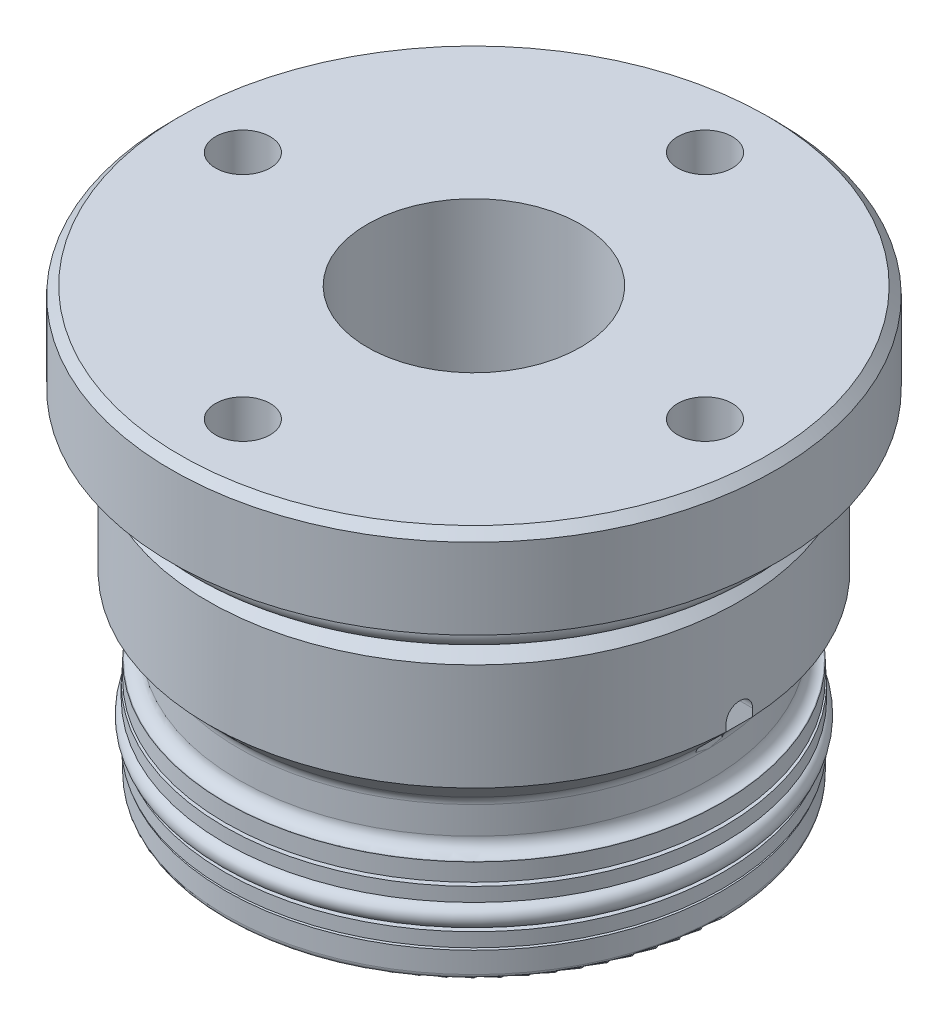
ISO-10303-21;
HEADER;
FILE_DESCRIPTION(('STEP AP214'),'2;1');
FILE_NAME('part.step','',(''),(''),'','','');
FILE_SCHEMA(('AUTOMOTIVE_DESIGN { 1 0 10303 214 1 1 1 1 }'));
ENDSEC;
DATA;
#1=APPLICATION_CONTEXT('core data for automotive mechanical design processes');
#2=APPLICATION_PROTOCOL_DEFINITION('international standard','automotive_design',2000,#1);
#3=PRODUCT_CONTEXT('',#1,'mechanical');
#4=PRODUCT('Part','Part','',(#3));
#5=PRODUCT_RELATED_PRODUCT_CATEGORY('part','',(#4));
#6=PRODUCT_DEFINITION_FORMATION('','',#4);
#7=PRODUCT_DEFINITION_CONTEXT('part definition',#1,'design');
#8=PRODUCT_DEFINITION('design','',#6,#7);
#9=PRODUCT_DEFINITION_SHAPE('','',#8);
#10=(LENGTH_UNIT() NAMED_UNIT(*) SI_UNIT(.MILLI.,.METRE.));
#11=(NAMED_UNIT(*) PLANE_ANGLE_UNIT() SI_UNIT($,.RADIAN.));
#12=(NAMED_UNIT(*) SI_UNIT($,.STERADIAN.) SOLID_ANGLE_UNIT());
#13=UNCERTAINTY_MEASURE_WITH_UNIT(LENGTH_MEASURE(1.E-05),#10,'distance_accuracy_value','');
#14=(GEOMETRIC_REPRESENTATION_CONTEXT(3) GLOBAL_UNCERTAINTY_ASSIGNED_CONTEXT((#13)) GLOBAL_UNIT_ASSIGNED_CONTEXT((#10,
#11,#12)) REPRESENTATION_CONTEXT('',''));
#15=CARTESIAN_POINT('',(0.,0.,0.));
#16=DIRECTION('',(0.,0.,1.));
#17=DIRECTION('',(1.,0.,0.));
#18=AXIS2_PLACEMENT_3D('',#15,#16,#17);
#19=CARTESIAN_POINT('',(0.,16.0274,0.));
#20=DIRECTION('',(0.,1.,0.));
#21=DIRECTION('',(0.,0.,1.));
#22=AXIS2_PLACEMENT_3D('',#19,#20,#21);
#23=CONICAL_SURFACE('',#22,23.7363,0.78539816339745);
#24=CARTESIAN_POINT('',(0.,16.0274,0.));
#25=DIRECTION('',(0.,-1.,0.));
#26=DIRECTION('',(0.,0.,-1.));
#27=AXIS2_PLACEMENT_3D('',#24,#25,#26);
#28=CIRCLE('',#27,23.7363);
#29=CARTESIAN_POINT('',(23.7068964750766,16.0274,1.1811));
#30=VERTEX_POINT('',#29);
#31=CARTESIAN_POINT('',(-23.7068964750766,16.0274,1.1811));
#32=VERTEX_POINT('',#31);
#33=EDGE_CURVE('E471',#30,#32,#28,.T.);
#34=ORIENTED_EDGE('',*,*,#33,.T.);
#35=CARTESIAN_POINT('',(-27.230014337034,19.5467173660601,1.1811));
#36=CARTESIAN_POINT('',(-26.4340846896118,18.7515380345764,1.1811));
#37=CARTESIAN_POINT('',(-25.6381249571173,17.9563888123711,1.1811));
#38=CARTESIAN_POINT('',(-24.0461185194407,16.3661774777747,1.1811));
#39=CARTESIAN_POINT('',(-23.2500718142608,15.5711153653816,1.1811));
#40=CARTESIAN_POINT('',(-21.6578645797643,13.981105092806,1.1811));
#41=CARTESIAN_POINT('',(-20.8617040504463,13.1861569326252,1.1811));
#42=CARTESIAN_POINT('',(-19.2692172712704,11.5964265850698,1.1811));
#43=CARTESIAN_POINT('',(-18.4728910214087,10.8016443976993,1.1811));
#44=CARTESIAN_POINT('',(-17.6764559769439,10.0069712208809,1.1811));
#45=B_SPLINE_CURVE_WITH_KNOTS('',3,(#35,#36,#37,#38,#39,#40,#41,#42,#43,#44),.UNSPECIFIED.,.F.,
.F.,(4,2,2,2,4),(0.,3.37525222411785,6.75050436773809,10.1257565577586,13.5010088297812),.UNSPECIFIED.);
#46=CARTESIAN_POINT('',(-21.2951482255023,13.6189769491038,1.1811));
#47=VERTEX_POINT('',#46);
#48=EDGE_CURVE('E306',#32,#47,#45,.T.);
#49=ORIENTED_EDGE('',*,*,#48,.T.);
#50=CARTESIAN_POINT('',(0.,13.6189769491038,0.));
#51=DIRECTION('',(0.,1.,0.));
#52=DIRECTION('',(0.,0.,1.));
#53=AXIS2_PLACEMENT_3D('',#50,#51,#52);
#54=CIRCLE('',#53,21.3278769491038);
#55=CARTESIAN_POINT('',(21.2951482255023,13.6189769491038,1.1811));
#56=VERTEX_POINT('',#55);
#57=EDGE_CURVE('E360',#47,#56,#54,.T.);
#58=ORIENTED_EDGE('',*,*,#57,.T.);
#59=CARTESIAN_POINT('',(26.2424089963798,18.5600746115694,1.1811));
#60=CARTESIAN_POINT('',(25.446450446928,17.7649242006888,1.1811));
#61=CARTESIAN_POINT('',(24.6504585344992,16.9698071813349,1.1811));
#62=CARTESIAN_POINT('',(23.0583764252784,15.3796715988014,1.1811));
#63=CARTESIAN_POINT('',(22.2622862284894,14.5846530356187,1.1811));
#64=CARTESIAN_POINT('',(20.6699759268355,12.9947459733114,1.1811));
#65=CARTESIAN_POINT('',(19.8737558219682,12.1998574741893,1.1811));
#66=CARTESIAN_POINT('',(18.2811225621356,10.610273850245,1.1811));
#67=CARTESIAN_POINT('',(17.4847094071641,9.81557872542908,1.1811));
#68=CARTESIAN_POINT('',(16.6881681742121,9.02101196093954,1.1811));
#69=B_SPLINE_CURVE_WITH_KNOTS('',3,(#59,#60,#61,#62,#63,#64,#65,#66,#67,#68),.UNSPECIFIED.,.F.,
.F.,(4,2,2,2,4),(0.,3.37525224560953,6.75050438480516,10.1257565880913,13.5010089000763),.UNSPECIFIED.);
#70=EDGE_CURVE('E321',#30,#56,#69,.T.);
#71=ORIENTED_EDGE('',*,*,#70,.F.);
#72=EDGE_LOOP('',(#34,#49,#58,#71));
#73=FACE_BOUND('',#72,.T.);
#74=ADVANCED_FACE('F33',(#73),#23,.T.);
#75=CARTESIAN_POINT('',(0.,12.8107538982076,0.));
#76=DIRECTION('',(0.,-1.,0.));
#77=DIRECTION('',(0.,0.,-1.));
#78=AXIS2_PLACEMENT_3D('',#75,#76,#77);
#79=TOROIDAL_SURFACE('',#78,22.1361,1.143);
#80=ORIENTED_EDGE('',*,*,#57,.F.);
#81=CARTESIAN_POINT('',(-20.9653592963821,12.9227690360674,1.1811));
#82=CARTESIAN_POINT('',(-20.9590688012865,12.8589619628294,1.1811));
#83=CARTESIAN_POINT('',(-20.9581633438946,12.7945770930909,1.1811));
#84=CARTESIAN_POINT('',(-20.9671779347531,12.6665163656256,1.1811));
#85=CARTESIAN_POINT('',(-20.9771109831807,12.6028414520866,1.1811));
#86=CARTESIAN_POINT('',(-21.0075239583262,12.4780899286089,1.1811));
#87=CARTESIAN_POINT('',(-21.0279986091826,12.4170120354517,1.1811));
#88=CARTESIAN_POINT('',(-21.078900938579,12.299174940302,1.1811));
#89=CARTESIAN_POINT('',(-21.1093261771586,12.2424146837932,1.1811));
#90=CARTESIAN_POINT('',(-21.1792847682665,12.1347637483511,1.1811));
#91=CARTESIAN_POINT('',(-21.2188239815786,12.0838768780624,1.1811));
#92=CARTESIAN_POINT('',(-21.3058749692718,11.9894498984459,1.1811));
#93=CARTESIAN_POINT('',(-21.3533871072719,11.9459101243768,1.1811));
#94=CARTESIAN_POINT('',(-21.4551040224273,11.8673506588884,1.1811));
#95=CARTESIAN_POINT('',(-21.5093179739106,11.8323428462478,1.1811));
#96=CARTESIAN_POINT('',(-21.6228471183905,11.7719108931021,1.1811));
#97=CARTESIAN_POINT('',(-21.682162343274,11.7464868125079,1.1811));
#98=CARTESIAN_POINT('',(-21.8043005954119,11.7059080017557,1.1811));
#99=CARTESIAN_POINT('',(-21.8671284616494,11.6907678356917,1.1811));
#100=CARTESIAN_POINT('',(-21.9944336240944,11.6712411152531,1.1811));
#101=CARTESIAN_POINT('',(-22.0589109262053,11.6668545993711,1.1811));
#102=CARTESIAN_POINT('',(-22.1877381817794,11.6689601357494,1.1811));
#103=CARTESIAN_POINT('',(-22.2520879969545,11.6754606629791,1.1811));
#104=CARTESIAN_POINT('',(-22.3787827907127,11.699174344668,1.1811));
#105=CARTESIAN_POINT('',(-22.44112776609,11.7163875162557,1.1811));
#106=CARTESIAN_POINT('',(-22.5620316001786,11.7610386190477,1.1811));
#107=CARTESIAN_POINT('',(-22.6205910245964,11.7884750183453,1.1811));
#108=CARTESIAN_POINT('',(-22.7322665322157,11.8527986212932,1.1811));
#109=CARTESIAN_POINT('',(-22.7853826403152,11.8896857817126,1.1811));
#110=CARTESIAN_POINT('',(-22.884608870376,11.9718280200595,1.1811));
#111=CARTESIAN_POINT('',(-22.9307255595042,12.0170751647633,1.1811));
#112=CARTESIAN_POINT('',(-23.0146959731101,12.1146784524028,1.1811));
#113=CARTESIAN_POINT('',(-23.0525497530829,12.1670345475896,1.1811));
#114=CARTESIAN_POINT('',(-23.1188677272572,12.27729663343,1.1811));
#115=CARTESIAN_POINT('',(-23.1473440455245,12.3351953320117,1.1811));
#116=CARTESIAN_POINT('',(-23.1941596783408,12.4549554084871,1.1811));
#117=CARTESIAN_POINT('',(-23.2124990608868,12.5168167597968,1.1811));
#118=CARTESIAN_POINT('',(-23.2385008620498,12.6426718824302,1.1811));
#119=CARTESIAN_POINT('',(-23.2461751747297,12.7066631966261,1.1811));
#120=CARTESIAN_POINT('',(-23.2506656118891,12.8350255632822,1.1811));
#121=CARTESIAN_POINT('',(-23.2474817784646,12.8993966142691,1.1811));
#122=CARTESIAN_POINT('',(-23.2303515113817,13.0266569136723,1.1811));
#123=CARTESIAN_POINT('',(-23.21641052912,13.0895468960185,1.1811));
#124=CARTESIAN_POINT('',(-23.1781710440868,13.212094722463,1.1811));
#125=CARTESIAN_POINT('',(-23.1538725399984,13.2717525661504,1.1811));
#126=CARTESIAN_POINT('',(-23.0956030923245,13.3861626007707,1.1811));
#127=CARTESIAN_POINT('',(-23.0616293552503,13.4409133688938,1.1811));
#128=CARTESIAN_POINT('',(-22.9849806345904,13.5439413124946,1.1811));
#129=CARTESIAN_POINT('',(-22.942305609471,13.5922184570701,1.1811));
#130=CARTESIAN_POINT('',(-22.8494222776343,13.6809804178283,1.1811));
#131=CARTESIAN_POINT('',(-22.7992066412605,13.7214575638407,1.1811));
#132=CARTESIAN_POINT('',(-22.6927000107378,13.7934197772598,1.1811));
#133=CARTESIAN_POINT('',(-22.6364089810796,13.8249047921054,1.1811));
#134=CARTESIAN_POINT('',(-22.5192711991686,13.8780321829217,1.1811));
#135=CARTESIAN_POINT('',(-22.4584186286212,13.8996617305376,1.1811));
#136=CARTESIAN_POINT('',(-22.3339479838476,13.9324102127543,1.1811));
#137=CARTESIAN_POINT('',(-22.2703298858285,13.9435290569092,1.1811));
#138=CARTESIAN_POINT('',(-22.142059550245,13.9549506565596,1.1811));
#139=CARTESIAN_POINT('',(-22.0774062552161,13.955241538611,1.1811));
#140=CARTESIAN_POINT('',(-21.9489673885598,13.9449697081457,1.1811));
#141=CARTESIAN_POINT('',(-21.8851818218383,13.9344069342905,1.1811));
#142=CARTESIAN_POINT('',(-21.7602613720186,13.9027187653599,1.1811));
#143=CARTESIAN_POINT('',(-21.6991276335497,13.8815888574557,1.1811));
#144=CARTESIAN_POINT('',(-21.5812802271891,13.8293610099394,1.1811));
#145=CARTESIAN_POINT('',(-21.5245663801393,13.7982634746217,1.1811));
#146=CARTESIAN_POINT('',(-21.4172055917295,13.7270015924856,1.1811));
#147=CARTESIAN_POINT('',(-21.3665548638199,13.6868429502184,1.1811));
#148=CARTESIAN_POINT('',(-21.2727121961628,13.5985702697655,1.1811));
#149=CARTESIAN_POINT('',(-21.2295220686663,13.5504543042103,1.1811));
#150=CARTESIAN_POINT('',(-21.1518859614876,13.4476891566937,1.1811));
#151=CARTESIAN_POINT('',(-21.1174329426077,13.3930452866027,1.1811));
#152=CARTESIAN_POINT('',(-21.0582434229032,13.2787841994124,1.1811));
#153=CARTESIAN_POINT('',(-21.0334951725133,13.2191731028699,1.1811));
#154=CARTESIAN_POINT('',(-21.0017392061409,13.1197424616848,1.1811));
#155=CARTESIAN_POINT('',(-20.9915597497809,13.0809057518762,1.1811));
#156=CARTESIAN_POINT('',(-20.9753374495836,13.0023777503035,1.1811));
#157=CARTESIAN_POINT('',(-20.9692946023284,12.9626864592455,1.1811));
#158=CARTESIAN_POINT('',(-20.9653592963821,12.9227690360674,1.1811));
#159=B_SPLINE_CURVE_WITH_KNOTS('',3,(#81,#82,#83,#84,#85,#86,#87,#88,#89,#90,#91,#92,#93,#94,
#95,#96,#97,#98,#99,#100,#101,#102,#103,#104,#105,#106,#107,#108,#109,#110,#111,#112,#113,#114,
#115,#116,#117,#118,#119,#120,#121,#122,#123,#124,#125,#126,#127,#128,#129,#130,#131,#132,#133,
#134,#135,#136,#137,#138,#139,#140,#141,#142,#143,#144,#145,#146,#147,#148,#149,#150,#151,#152,
#153,#154,#155,#156,#157,#158),.UNSPECIFIED.,.T.,.F.,(4,2,2,2,2,2,2,2,2,2,2,2,2,2,2,2,2,2,2,2,2,
2,2,2,2,2,2,2,2,2,2,2,2,2,2,2,2,2,4),(0.,0.192202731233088,0.384636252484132,0.576973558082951,
0.769263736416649,0.961677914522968,1.15410087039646,1.34679021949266,1.53948077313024,
1.73244364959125,1.92540721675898,2.11852106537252,2.3116352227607,2.50472045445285,
2.6978048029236,2.89070685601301,3.08360761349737,3.2762579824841,3.46890705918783,
3.6613411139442,3.85377442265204,4.04611027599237,4.23844615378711,4.43083762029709,
4.62323000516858,4.81581062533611,5.00839237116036,5.20122407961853,5.39405744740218,
5.58710226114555,5.78014816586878,5.97327658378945,6.16639716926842,6.35939651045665,
6.55244266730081,6.74533279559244,6.93798866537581,7.05822994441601,7.17847112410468),.UNSPECIFIED.);
#160=CARTESIAN_POINT('',(-20.9931,13.0842323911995,1.1811));
#161=VERTEX_POINT('',#160);
#162=EDGE_CURVE('E302',#47,#161,#159,.T.);
#163=ORIENTED_EDGE('',*,*,#162,.T.);
#164=CARTESIAN_POINT('',(-20.9931,12.8107538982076,0.));
#165=CARTESIAN_POINT('',(-20.9931,12.8129488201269,0.00940664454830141));
#166=CARTESIAN_POINT('',(-20.9931,12.8151437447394,0.018813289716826));
#167=CARTESIAN_POINT('',(-20.9931,12.9039273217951,0.399311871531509));
#168=CARTESIAN_POINT('',(-20.9931,12.9904772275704,0.770414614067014));
#169=CARTESIAN_POINT('',(-20.9931,13.1176860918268,1.32759976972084));
#170=CARTESIAN_POINT('',(-20.9931,13.1596456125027,1.5133826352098));
#171=CARTESIAN_POINT('',(-20.9931,13.2422594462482,1.88528176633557));
#172=CARTESIAN_POINT('',(-20.9931,13.2829134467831,2.07139810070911));
#173=CARTESIAN_POINT('',(-20.9931,13.4167665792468,2.69840828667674));
#174=CARTESIAN_POINT('',(-20.9931,13.5059207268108,3.14020347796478));
#175=CARTESIAN_POINT('',(-20.9931,13.6269269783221,3.80502728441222));
#176=CARTESIAN_POINT('',(-20.9931,13.6651280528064,4.02689579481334));
#177=CARTESIAN_POINT('',(-20.9931,13.7362265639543,4.47151818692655));
#178=CARTESIAN_POINT('',(-20.9931,13.7691233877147,4.69427216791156));
#179=CARTESIAN_POINT('',(-20.9931,13.8285187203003,5.14193974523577));
#180=CARTESIAN_POINT('',(-20.9931,13.8549795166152,5.36685840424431));
#181=CARTESIAN_POINT('',(-20.9931,13.8996728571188,5.8174669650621));
#182=CARTESIAN_POINT('',(-20.9931,13.9179082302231,6.04315657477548));
#183=CARTESIAN_POINT('',(-20.9931,13.9375746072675,6.38254637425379));
#184=CARTESIAN_POINT('',(-20.9931,13.9428515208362,6.49602706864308));
#185=CARTESIAN_POINT('',(-20.9931,13.9504808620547,6.72308112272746));
#186=CARTESIAN_POINT('',(-20.9931,13.9528335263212,6.8366544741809));
#187=CARTESIAN_POINT('',(-20.9931,13.9542363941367,7.06396092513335));
#188=CARTESIAN_POINT('',(-20.9931,13.9532827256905,7.17769405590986));
#189=CARTESIAN_POINT('',(-20.9931,13.9475641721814,7.40509391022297));
#190=CARTESIAN_POINT('',(-20.9931,13.9427982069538,7.51876060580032));
#191=CARTESIAN_POINT('',(-20.9931,13.9358760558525,7.63231521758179));
#192=B_SPLINE_CURVE_WITH_KNOTS('',3,(#164,#165,#166,#167,#168,#169,#170,#171,#172,#173,#174,
#175,#176,#177,#178,#179,#180,#181,#182,#183,#184,#185,#186,#187,#188,#189,#190,#191),
.UNSPECIFIED.,.F.,.F.,(4,2,2,2,2,2,2,2,2,2,2,2,2,4),(0.,0.0289779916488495,1.17215823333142,
1.74353939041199,2.31505632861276,3.66690446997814,4.34225565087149,5.01768481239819,
5.69698119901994,6.3760437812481,6.71682306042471,7.05757476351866,7.39872565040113,
7.73997323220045),.UNSPECIFIED.);
#193=CARTESIAN_POINT('',(-20.9931,12.8107538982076,0.));
#194=VERTEX_POINT('',#193);
#195=EDGE_CURVE('E276',#194,#161,#192,.T.);
#196=ORIENTED_EDGE('',*,*,#195,.F.);
#197=CARTESIAN_POINT('',(0.,12.8107538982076,0.));
#198=DIRECTION('',(0.,-1.,0.));
#199=DIRECTION('',(0.,0.,-1.));
#200=AXIS2_PLACEMENT_3D('',#197,#198,#199);
#201=CIRCLE('',#200,20.9931);
#202=CARTESIAN_POINT('',(20.9931,12.8107538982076,0.));
#203=VERTEX_POINT('',#202);
#204=EDGE_CURVE('E365',#203,#194,#201,.T.);
#205=ORIENTED_EDGE('',*,*,#204,.F.);
#206=CARTESIAN_POINT('',(20.9931,12.8107538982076,0.));
#207=CARTESIAN_POINT('',(20.9931,12.8129488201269,0.00940664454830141));
#208=CARTESIAN_POINT('',(20.9931,12.8151437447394,0.018813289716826));
#209=CARTESIAN_POINT('',(20.9931,12.9039273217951,0.399311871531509));
#210=CARTESIAN_POINT('',(20.9931,12.9904772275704,0.770414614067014));
#211=CARTESIAN_POINT('',(20.9931,13.1176860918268,1.32759976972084));
#212=CARTESIAN_POINT('',(20.9931,13.1596456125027,1.5133826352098));
#213=CARTESIAN_POINT('',(20.9931,13.2422594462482,1.88528176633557));
#214=CARTESIAN_POINT('',(20.9931,13.2829134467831,2.07139810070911));
#215=CARTESIAN_POINT('',(20.9931,13.4167665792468,2.69840828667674));
#216=CARTESIAN_POINT('',(20.9931,13.5059207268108,3.14020347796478));
#217=CARTESIAN_POINT('',(20.9931,13.6269269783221,3.80502728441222));
#218=CARTESIAN_POINT('',(20.9931,13.6651280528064,4.02689579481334));
#219=CARTESIAN_POINT('',(20.9931,13.7362265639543,4.47151818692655));
#220=CARTESIAN_POINT('',(20.9931,13.7691233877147,4.69427216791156));
#221=CARTESIAN_POINT('',(20.9931,13.8285187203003,5.14193974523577));
#222=CARTESIAN_POINT('',(20.9931,13.8549795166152,5.36685840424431));
#223=CARTESIAN_POINT('',(20.9931,13.8996728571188,5.8174669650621));
#224=CARTESIAN_POINT('',(20.9931,13.9179082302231,6.04315657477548));
#225=CARTESIAN_POINT('',(20.9931,13.9375746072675,6.38254637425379));
#226=CARTESIAN_POINT('',(20.9931,13.9428515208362,6.49602706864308));
#227=CARTESIAN_POINT('',(20.9931,13.9504808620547,6.72308112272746));
#228=CARTESIAN_POINT('',(20.9931,13.9528335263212,6.8366544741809));
#229=CARTESIAN_POINT('',(20.9931,13.9542363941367,7.06396092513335));
#230=CARTESIAN_POINT('',(20.9931,13.9532827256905,7.17769405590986));
#231=CARTESIAN_POINT('',(20.9931,13.9475641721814,7.40509391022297));
#232=CARTESIAN_POINT('',(20.9931,13.9427982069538,7.51876060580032));
#233=CARTESIAN_POINT('',(20.9931,13.9358760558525,7.63231521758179));
#234=B_SPLINE_CURVE_WITH_KNOTS('',3,(#206,#207,#208,#209,#210,#211,#212,#213,#214,#215,#216,
#217,#218,#219,#220,#221,#222,#223,#224,#225,#226,#227,#228,#229,#230,#231,#232,#233),
.UNSPECIFIED.,.F.,.F.,(4,2,2,2,2,2,2,2,2,2,2,2,2,4),(0.,0.0289779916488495,1.17215823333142,
1.74353939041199,2.31505632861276,3.66690446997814,4.34225565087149,5.01768481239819,
5.69698119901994,6.3760437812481,6.71682306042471,7.05757476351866,7.39872565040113,
7.73997323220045),.UNSPECIFIED.);
#235=CARTESIAN_POINT('',(20.9931,13.0842323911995,1.1811));
#236=VERTEX_POINT('',#235);
#237=EDGE_CURVE('E243',#236,#203,#234,.F.);
#238=ORIENTED_EDGE('',*,*,#237,.F.);
#239=CARTESIAN_POINT('',(20.9653592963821,12.9227690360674,1.1811));
#240=CARTESIAN_POINT('',(20.9590688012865,12.8589619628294,1.1811));
#241=CARTESIAN_POINT('',(20.9581633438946,12.7945770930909,1.1811));
#242=CARTESIAN_POINT('',(20.9671779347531,12.6665163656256,1.1811));
#243=CARTESIAN_POINT('',(20.9771109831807,12.6028414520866,1.1811));
#244=CARTESIAN_POINT('',(21.0075239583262,12.4780899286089,1.1811));
#245=CARTESIAN_POINT('',(21.0279986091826,12.4170120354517,1.1811));
#246=CARTESIAN_POINT('',(21.078900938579,12.299174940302,1.1811));
#247=CARTESIAN_POINT('',(21.1093261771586,12.2424146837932,1.1811));
#248=CARTESIAN_POINT('',(21.1792847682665,12.1347637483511,1.1811));
#249=CARTESIAN_POINT('',(21.2188239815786,12.0838768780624,1.1811));
#250=CARTESIAN_POINT('',(21.3058749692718,11.9894498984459,1.1811));
#251=CARTESIAN_POINT('',(21.3533871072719,11.9459101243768,1.1811));
#252=CARTESIAN_POINT('',(21.4551040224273,11.8673506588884,1.1811));
#253=CARTESIAN_POINT('',(21.5093179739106,11.8323428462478,1.1811));
#254=CARTESIAN_POINT('',(21.6228471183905,11.7719108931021,1.1811));
#255=CARTESIAN_POINT('',(21.682162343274,11.7464868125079,1.1811));
#256=CARTESIAN_POINT('',(21.8043005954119,11.7059080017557,1.1811));
#257=CARTESIAN_POINT('',(21.8671284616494,11.6907678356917,1.1811));
#258=CARTESIAN_POINT('',(21.9944336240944,11.6712411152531,1.1811));
#259=CARTESIAN_POINT('',(22.0589109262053,11.6668545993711,1.1811));
#260=CARTESIAN_POINT('',(22.1877381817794,11.6689601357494,1.1811));
#261=CARTESIAN_POINT('',(22.2520879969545,11.6754606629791,1.1811));
#262=CARTESIAN_POINT('',(22.3787827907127,11.699174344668,1.1811));
#263=CARTESIAN_POINT('',(22.44112776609,11.7163875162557,1.1811));
#264=CARTESIAN_POINT('',(22.5620316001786,11.7610386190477,1.1811));
#265=CARTESIAN_POINT('',(22.6205910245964,11.7884750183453,1.1811));
#266=CARTESIAN_POINT('',(22.7322665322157,11.8527986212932,1.1811));
#267=CARTESIAN_POINT('',(22.7853826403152,11.8896857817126,1.1811));
#268=CARTESIAN_POINT('',(22.884608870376,11.9718280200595,1.1811));
#269=CARTESIAN_POINT('',(22.9307255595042,12.0170751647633,1.1811));
#270=CARTESIAN_POINT('',(23.0146959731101,12.1146784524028,1.1811));
#271=CARTESIAN_POINT('',(23.0525497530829,12.1670345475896,1.1811));
#272=CARTESIAN_POINT('',(23.1188677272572,12.27729663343,1.1811));
#273=CARTESIAN_POINT('',(23.1473440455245,12.3351953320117,1.1811));
#274=CARTESIAN_POINT('',(23.1941596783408,12.4549554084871,1.1811));
#275=CARTESIAN_POINT('',(23.2124990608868,12.5168167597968,1.1811));
#276=CARTESIAN_POINT('',(23.2385008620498,12.6426718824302,1.1811));
#277=CARTESIAN_POINT('',(23.2461751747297,12.7066631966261,1.1811));
#278=CARTESIAN_POINT('',(23.2506656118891,12.8350255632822,1.1811));
#279=CARTESIAN_POINT('',(23.2474817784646,12.8993966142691,1.1811));
#280=CARTESIAN_POINT('',(23.2303515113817,13.0266569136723,1.1811));
#281=CARTESIAN_POINT('',(23.21641052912,13.0895468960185,1.1811));
#282=CARTESIAN_POINT('',(23.1781710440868,13.212094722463,1.1811));
#283=CARTESIAN_POINT('',(23.1538725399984,13.2717525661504,1.1811));
#284=CARTESIAN_POINT('',(23.0956030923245,13.3861626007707,1.1811));
#285=CARTESIAN_POINT('',(23.0616293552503,13.4409133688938,1.1811));
#286=CARTESIAN_POINT('',(22.9849806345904,13.5439413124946,1.1811));
#287=CARTESIAN_POINT('',(22.942305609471,13.5922184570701,1.1811));
#288=CARTESIAN_POINT('',(22.8494222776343,13.6809804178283,1.1811));
#289=CARTESIAN_POINT('',(22.7992066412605,13.7214575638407,1.1811));
#290=CARTESIAN_POINT('',(22.6927000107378,13.7934197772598,1.1811));
#291=CARTESIAN_POINT('',(22.6364089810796,13.8249047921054,1.1811));
#292=CARTESIAN_POINT('',(22.5192711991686,13.8780321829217,1.1811));
#293=CARTESIAN_POINT('',(22.4584186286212,13.8996617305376,1.1811));
#294=CARTESIAN_POINT('',(22.3339479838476,13.9324102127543,1.1811));
#295=CARTESIAN_POINT('',(22.2703298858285,13.9435290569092,1.1811));
#296=CARTESIAN_POINT('',(22.142059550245,13.9549506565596,1.1811));
#297=CARTESIAN_POINT('',(22.0774062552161,13.955241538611,1.1811));
#298=CARTESIAN_POINT('',(21.9489673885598,13.9449697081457,1.1811));
#299=CARTESIAN_POINT('',(21.8851818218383,13.9344069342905,1.1811));
#300=CARTESIAN_POINT('',(21.7602613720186,13.9027187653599,1.1811));
#301=CARTESIAN_POINT('',(21.6991276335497,13.8815888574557,1.1811));
#302=CARTESIAN_POINT('',(21.5812802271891,13.8293610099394,1.1811));
#303=CARTESIAN_POINT('',(21.5245663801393,13.7982634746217,1.1811));
#304=CARTESIAN_POINT('',(21.4172055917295,13.7270015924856,1.1811));
#305=CARTESIAN_POINT('',(21.3665548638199,13.6868429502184,1.1811));
#306=CARTESIAN_POINT('',(21.2727121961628,13.5985702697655,1.1811));
#307=CARTESIAN_POINT('',(21.2295220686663,13.5504543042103,1.1811));
#308=CARTESIAN_POINT('',(21.1518859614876,13.4476891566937,1.1811));
#309=CARTESIAN_POINT('',(21.1174329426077,13.3930452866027,1.1811));
#310=CARTESIAN_POINT('',(21.0582434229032,13.2787841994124,1.1811));
#311=CARTESIAN_POINT('',(21.0334951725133,13.2191731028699,1.1811));
#312=CARTESIAN_POINT('',(21.0017392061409,13.1197424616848,1.1811));
#313=CARTESIAN_POINT('',(20.9915597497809,13.0809057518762,1.1811));
#314=CARTESIAN_POINT('',(20.9753374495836,13.0023777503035,1.1811));
#315=CARTESIAN_POINT('',(20.9692946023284,12.9626864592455,1.1811));
#316=CARTESIAN_POINT('',(20.9653592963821,12.9227690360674,1.1811));
#317=B_SPLINE_CURVE_WITH_KNOTS('',3,(#239,#240,#241,#242,#243,#244,#245,#246,#247,#248,#249,
#250,#251,#252,#253,#254,#255,#256,#257,#258,#259,#260,#261,#262,#263,#264,#265,#266,#267,#268,
#269,#270,#271,#272,#273,#274,#275,#276,#277,#278,#279,#280,#281,#282,#283,#284,#285,#286,#287,
#288,#289,#290,#291,#292,#293,#294,#295,#296,#297,#298,#299,#300,#301,#302,#303,#304,#305,#306,
#307,#308,#309,#310,#311,#312,#313,#314,#315,#316),.UNSPECIFIED.,.T.,.F.,(4,2,2,2,2,2,2,2,2,2,2,
2,2,2,2,2,2,2,2,2,2,2,2,2,2,2,2,2,2,2,2,2,2,2,2,2,2,2,4),(0.,0.192202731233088,
0.384636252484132,0.576973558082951,0.769263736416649,0.961677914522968,1.15410087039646,
1.34679021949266,1.53948077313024,1.73244364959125,1.92540721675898,2.11852106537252,
2.3116352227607,2.50472045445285,2.6978048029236,2.89070685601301,3.08360761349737,
3.2762579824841,3.46890705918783,3.6613411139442,3.85377442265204,4.04611027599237,
4.23844615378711,4.43083762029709,4.62323000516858,4.81581062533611,5.00839237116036,
5.20122407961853,5.39405744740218,5.58710226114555,5.78014816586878,5.97327658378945,
6.16639716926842,6.35939651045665,6.55244266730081,6.74533279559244,6.93798866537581,
7.05822994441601,7.17847112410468),.UNSPECIFIED.);
#318=EDGE_CURVE('E259',#56,#236,#317,.T.);
#319=ORIENTED_EDGE('',*,*,#318,.F.);
#320=EDGE_LOOP('',(#80,#163,#196,#205,#238,#319));
#321=FACE_BOUND('',#320,.T.);
#322=ADVANCED_FACE('F207',(#321),#79,.F.);
#323=CARTESIAN_POINT('',(0.,0.,0.));
#324=DIRECTION('',(0.,-1.,0.));
#325=DIRECTION('',(0.,0.,-1.));
#326=AXIS2_PLACEMENT_3D('',#323,#324,#325);
#327=CYLINDRICAL_SURFACE('',#326,23.7363);
#328=CARTESIAN_POINT('',(0.,25.5524,0.));
#329=DIRECTION('',(0.,-1.,0.));
#330=DIRECTION('',(0.,0.,-1.));
#331=AXIS2_PLACEMENT_3D('',#328,#329,#330);
#332=CIRCLE('',#331,23.7363);
#333=CARTESIAN_POINT('',(0.,25.5524,-23.7363));
#334=VERTEX_POINT('',#333);
#335=EDGE_CURVE('E406',#334,#334,#332,.T.);
#336=ORIENTED_EDGE('',*,*,#335,.T.);
#337=EDGE_LOOP('',(#336));
#338=FACE_BOUND('',#337,.T.);
#339=CARTESIAN_POINT('',(-23.7160930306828,16.0274,-0.979218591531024));
#340=CARTESIAN_POINT('',(-23.7153263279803,16.0549284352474,-0.997783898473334));
#341=CARTESIAN_POINT('',(-23.7145864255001,16.0832273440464,-1.01517952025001));
#342=CARTESIAN_POINT('',(-23.7131795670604,16.1411884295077,-1.04752833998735));
#343=CARTESIAN_POINT('',(-23.7125126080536,16.1708505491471,-1.06248163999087));
#344=CARTESIAN_POINT('',(-23.7106520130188,16.2615240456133,-1.10348283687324));
#345=CARTESIAN_POINT('',(-23.7095961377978,16.3243098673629,-1.1257307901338));
#346=CARTESIAN_POINT('',(-23.7079748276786,16.4527299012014,-1.15937631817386));
#347=CARTESIAN_POINT('',(-23.7074096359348,16.5183655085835,-1.17076851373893));
#348=CARTESIAN_POINT('',(-23.7068335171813,16.6506146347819,-1.18237769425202));
#349=CARTESIAN_POINT('',(-23.7068224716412,16.7172279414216,-1.18259706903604));
#350=CARTESIAN_POINT('',(-23.7073556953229,16.8494985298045,-1.17185817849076));
#351=CARTESIAN_POINT('',(-23.7078995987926,16.9151564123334,-1.16090727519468));
#352=CARTESIAN_POINT('',(-23.7094807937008,17.0437114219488,-1.12815093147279));
#353=CARTESIAN_POINT('',(-23.7105181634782,17.1066081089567,-1.10634376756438));
#354=CARTESIAN_POINT('',(-23.7129696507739,17.2278633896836,-1.05248792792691));
#355=CARTESIAN_POINT('',(-23.7143838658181,17.2862208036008,-1.02043660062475));
#356=CARTESIAN_POINT('',(-23.7174294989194,17.3967265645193,-0.947006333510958));
#357=CARTESIAN_POINT('',(-23.719060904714,17.4488752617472,-0.905627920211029));
#358=CARTESIAN_POINT('',(-23.7223593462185,17.5455494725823,-0.814661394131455));
#359=CARTESIAN_POINT('',(-23.7240264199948,17.5900663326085,-0.765064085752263));
#360=CARTESIAN_POINT('',(-23.7272066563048,17.6701446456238,-0.659095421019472));
#361=CARTESIAN_POINT('',(-23.7287198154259,17.7057059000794,-0.602723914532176));
#362=CARTESIAN_POINT('',(-23.7314219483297,17.7668667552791,-0.484793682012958));
#363=CARTESIAN_POINT('',(-23.7326108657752,17.7924646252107,-0.423234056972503));
#364=CARTESIAN_POINT('',(-23.7345300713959,17.8329591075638,-0.296684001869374));
#365=CARTESIAN_POINT('',(-23.7352603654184,17.8478558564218,-0.231693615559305));
#366=CARTESIAN_POINT('',(-23.7361794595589,17.8665124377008,-0.100197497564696));
#367=CARTESIAN_POINT('',(-23.7363688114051,17.8702836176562,-0.0336933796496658));
#368=CARTESIAN_POINT('',(-23.7361862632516,17.8666133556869,0.0990037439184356));
#369=CARTESIAN_POINT('',(-23.7358143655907,17.8591719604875,0.165196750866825));
#370=CARTESIAN_POINT('',(-23.7345516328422,17.8332979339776,0.295349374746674));
#371=CARTESIAN_POINT('',(-23.7336611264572,17.814872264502,0.359310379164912));
#372=CARTESIAN_POINT('',(-23.7314615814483,17.7675607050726,0.483231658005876));
#373=CARTESIAN_POINT('',(-23.7301525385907,17.7386747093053,0.543191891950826));
#374=CARTESIAN_POINT('',(-23.7272619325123,17.6712375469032,0.657458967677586));
#375=CARTESIAN_POINT('',(-23.7256801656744,17.6326791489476,0.711761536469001));
#376=CARTESIAN_POINT('',(-23.7224227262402,17.5470012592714,0.81312623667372));
#377=CARTESIAN_POINT('',(-23.7207470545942,17.4998818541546,0.860188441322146));
#378=CARTESIAN_POINT('',(-23.7174887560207,17.3983654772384,0.945783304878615));
#379=CARTESIAN_POINT('',(-23.7159062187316,17.3439616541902,0.984307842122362));
#380=CARTESIAN_POINT('',(-23.7130144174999,17.2294491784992,1.05167792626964));
#381=CARTESIAN_POINT('',(-23.7117051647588,17.1693402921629,1.0805230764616));
#382=CARTESIAN_POINT('',(-23.7095083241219,17.0451439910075,1.12770290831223));
#383=CARTESIAN_POINT('',(-23.7086206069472,16.9810578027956,1.14604081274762));
#384=CARTESIAN_POINT('',(-23.7073667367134,16.8507152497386,1.17169406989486));
#385=CARTESIAN_POINT('',(-23.707000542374,16.7844590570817,1.179010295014));
#386=CARTESIAN_POINT('',(-23.7068311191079,16.6517289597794,1.18241256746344));
#387=CARTESIAN_POINT('',(-23.7070273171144,16.5852553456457,1.17851004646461));
#388=CARTESIAN_POINT('',(-23.7079592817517,16.4539042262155,1.15960814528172));
#389=CARTESIAN_POINT('',(-23.7086949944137,16.389026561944,1.14460987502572));
#390=CARTESIAN_POINT('',(-23.7104656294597,16.2730338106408,1.10727088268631));
#391=CARTESIAN_POINT('',(-23.7114323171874,16.2213980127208,1.08652357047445));
#392=CARTESIAN_POINT('',(-23.7136040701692,16.121576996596,1.03801742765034));
#393=CARTESIAN_POINT('',(-23.7148089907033,16.0733897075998,1.01026285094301));
#394=CARTESIAN_POINT('',(-23.7160930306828,16.0274,0.979218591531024));
#395=B_SPLINE_CURVE_WITH_KNOTS('',3,(#339,#340,#341,#342,#343,#344,#345,#346,#347,#348,#349,
#350,#351,#352,#353,#354,#355,#356,#357,#358,#359,#360,#361,#362,#363,#364,#365,#366,#367,#368,
#369,#370,#371,#372,#373,#374,#375,#376,#377,#378,#379,#380,#381,#382,#383,#384,#385,#386,#387,
#388,#389,#390,#391,#392,#393,#394),.UNSPECIFIED.,.F.,.F.,(4,2,2,2,2,2,2,2,2,2,2,2,2,2,2,2,2,2,
2,2,2,2,2,2,2,2,2,4),(0.,0.0995765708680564,0.199148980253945,0.397982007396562,
0.596913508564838,0.795802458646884,0.994560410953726,1.1933499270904,1.39219093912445,
1.59102072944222,1.7900744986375,1.98913268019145,2.18822542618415,2.38731563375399,
2.58620270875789,2.78508895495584,2.98384928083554,3.18261161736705,3.38152299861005,
3.58043236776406,3.77953014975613,3.97863609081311,4.17768092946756,4.37671001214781,
4.57553636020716,4.77434282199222,4.94077469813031,5.10710578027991),.UNSPECIFIED.);
#396=CARTESIAN_POINT('',(-23.7068964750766,16.6878,-1.1811));
#397=VERTEX_POINT('',#396);
#398=CARTESIAN_POINT('',(-23.7068964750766,16.6878,1.1811));
#399=VERTEX_POINT('',#398);
#400=EDGE_CURVE('E147',#397,#399,#395,.T.);
#401=ORIENTED_EDGE('',*,*,#400,.T.);
#402=DIRECTION('',(0.,-1.,0.));
#403=VECTOR('',#402,1.);
#404=CARTESIAN_POINT('',(-23.7068964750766,0.,1.1811));
#405=LINE('',#404,#403);
#406=EDGE_CURVE('E312',#399,#32,#405,.T.);
#407=ORIENTED_EDGE('',*,*,#406,.T.);
#408=ORIENTED_EDGE('',*,*,#33,.F.);
#409=DIRECTION('',(0.,-1.,0.));
#410=VECTOR('',#409,1.);
#411=CARTESIAN_POINT('',(23.7068964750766,0.,1.1811));
#412=LINE('',#411,#410);
#413=CARTESIAN_POINT('',(23.7068964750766,16.6878,1.1811));
#414=VERTEX_POINT('',#413);
#415=EDGE_CURVE('E325',#414,#30,#412,.T.);
#416=ORIENTED_EDGE('',*,*,#415,.F.);
#417=CARTESIAN_POINT('',(23.7160930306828,16.0274,0.979218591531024));
#418=CARTESIAN_POINT('',(23.7153263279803,16.0549284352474,0.997783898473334));
#419=CARTESIAN_POINT('',(23.7145864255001,16.0832273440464,1.01517952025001));
#420=CARTESIAN_POINT('',(23.7131795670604,16.1411884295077,1.04752833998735));
#421=CARTESIAN_POINT('',(23.7125126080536,16.1708505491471,1.06248163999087));
#422=CARTESIAN_POINT('',(23.7106520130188,16.2615240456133,1.10348283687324));
#423=CARTESIAN_POINT('',(23.7095961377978,16.3243098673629,1.1257307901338));
#424=CARTESIAN_POINT('',(23.7079748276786,16.4527299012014,1.15937631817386));
#425=CARTESIAN_POINT('',(23.7074096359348,16.5183655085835,1.17076851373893));
#426=CARTESIAN_POINT('',(23.7068335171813,16.6506146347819,1.18237769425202));
#427=CARTESIAN_POINT('',(23.7068224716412,16.7172279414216,1.18259706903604));
#428=CARTESIAN_POINT('',(23.7073556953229,16.8494985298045,1.17185817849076));
#429=CARTESIAN_POINT('',(23.7078995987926,16.9151564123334,1.16090727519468));
#430=CARTESIAN_POINT('',(23.7094807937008,17.0437114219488,1.12815093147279));
#431=CARTESIAN_POINT('',(23.7105181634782,17.1066081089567,1.10634376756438));
#432=CARTESIAN_POINT('',(23.7129696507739,17.2278633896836,1.05248792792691));
#433=CARTESIAN_POINT('',(23.7143838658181,17.2862208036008,1.02043660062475));
#434=CARTESIAN_POINT('',(23.7174294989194,17.3967265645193,0.947006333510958));
#435=CARTESIAN_POINT('',(23.719060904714,17.4488752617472,0.905627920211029));
#436=CARTESIAN_POINT('',(23.7223593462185,17.5455494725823,0.814661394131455));
#437=CARTESIAN_POINT('',(23.7240264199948,17.5900663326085,0.765064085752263));
#438=CARTESIAN_POINT('',(23.7272066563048,17.6701446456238,0.659095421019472));
#439=CARTESIAN_POINT('',(23.7287198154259,17.7057059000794,0.602723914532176));
#440=CARTESIAN_POINT('',(23.7314219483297,17.7668667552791,0.484793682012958));
#441=CARTESIAN_POINT('',(23.7326108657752,17.7924646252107,0.423234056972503));
#442=CARTESIAN_POINT('',(23.7345300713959,17.8329591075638,0.296684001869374));
#443=CARTESIAN_POINT('',(23.7352603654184,17.8478558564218,0.231693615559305));
#444=CARTESIAN_POINT('',(23.7361794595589,17.8665124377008,0.100197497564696));
#445=CARTESIAN_POINT('',(23.7363688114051,17.8702836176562,0.0336933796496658));
#446=CARTESIAN_POINT('',(23.7361862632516,17.8666133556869,-0.0990037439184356));
#447=CARTESIAN_POINT('',(23.7358143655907,17.8591719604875,-0.165196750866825));
#448=CARTESIAN_POINT('',(23.7345516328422,17.8332979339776,-0.295349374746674));
#449=CARTESIAN_POINT('',(23.7336611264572,17.814872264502,-0.359310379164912));
#450=CARTESIAN_POINT('',(23.7314615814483,17.7675607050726,-0.483231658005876));
#451=CARTESIAN_POINT('',(23.7301525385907,17.7386747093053,-0.543191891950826));
#452=CARTESIAN_POINT('',(23.7272619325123,17.6712375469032,-0.657458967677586));
#453=CARTESIAN_POINT('',(23.7256801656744,17.6326791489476,-0.711761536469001));
#454=CARTESIAN_POINT('',(23.7224227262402,17.5470012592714,-0.81312623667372));
#455=CARTESIAN_POINT('',(23.7207470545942,17.4998818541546,-0.860188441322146));
#456=CARTESIAN_POINT('',(23.7174887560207,17.3983654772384,-0.945783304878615));
#457=CARTESIAN_POINT('',(23.7159062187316,17.3439616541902,-0.984307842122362));
#458=CARTESIAN_POINT('',(23.7130144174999,17.2294491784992,-1.05167792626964));
#459=CARTESIAN_POINT('',(23.7117051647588,17.1693402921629,-1.0805230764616));
#460=CARTESIAN_POINT('',(23.7095083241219,17.0451439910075,-1.12770290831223));
#461=CARTESIAN_POINT('',(23.7086206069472,16.9810578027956,-1.14604081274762));
#462=CARTESIAN_POINT('',(23.7073667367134,16.8507152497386,-1.17169406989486));
#463=CARTESIAN_POINT('',(23.707000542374,16.7844590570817,-1.179010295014));
#464=CARTESIAN_POINT('',(23.7068311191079,16.6517289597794,-1.18241256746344));
#465=CARTESIAN_POINT('',(23.7070273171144,16.5852553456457,-1.17851004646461));
#466=CARTESIAN_POINT('',(23.7079592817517,16.4539042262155,-1.15960814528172));
#467=CARTESIAN_POINT('',(23.7086949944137,16.389026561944,-1.14460987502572));
#468=CARTESIAN_POINT('',(23.7104656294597,16.2730338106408,-1.10727088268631));
#469=CARTESIAN_POINT('',(23.7114323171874,16.2213980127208,-1.08652357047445));
#470=CARTESIAN_POINT('',(23.7136040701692,16.121576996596,-1.03801742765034));
#471=CARTESIAN_POINT('',(23.7148089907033,16.0733897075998,-1.01026285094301));
#472=CARTESIAN_POINT('',(23.7160930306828,16.0274,-0.979218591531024));
#473=B_SPLINE_CURVE_WITH_KNOTS('',3,(#417,#418,#419,#420,#421,#422,#423,#424,#425,#426,#427,
#428,#429,#430,#431,#432,#433,#434,#435,#436,#437,#438,#439,#440,#441,#442,#443,#444,#445,#446,
#447,#448,#449,#450,#451,#452,#453,#454,#455,#456,#457,#458,#459,#460,#461,#462,#463,#464,#465,
#466,#467,#468,#469,#470,#471,#472),.UNSPECIFIED.,.F.,.F.,(4,2,2,2,2,2,2,2,2,2,2,2,2,2,2,2,2,2,
2,2,2,2,2,2,2,2,2,4),(0.,0.0995765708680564,0.199148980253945,0.397982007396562,
0.596913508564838,0.795802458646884,0.994560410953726,1.1933499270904,1.39219093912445,
1.59102072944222,1.7900744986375,1.98913268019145,2.18822542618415,2.38731563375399,
2.58620270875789,2.78508895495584,2.98384928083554,3.18261161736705,3.38152299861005,
3.58043236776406,3.77953014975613,3.97863609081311,4.17768092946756,4.37671001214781,
4.57553636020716,4.77434282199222,4.94077469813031,5.10710578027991),.UNSPECIFIED.);
#474=CARTESIAN_POINT('',(23.7068964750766,16.6878,-1.1811));
#475=VERTEX_POINT('',#474);
#476=EDGE_CURVE('E194',#414,#475,#473,.T.);
#477=ORIENTED_EDGE('',*,*,#476,.T.);
#478=DIRECTION('',(0.,-1.,0.));
#479=VECTOR('',#478,1.);
#480=CARTESIAN_POINT('',(23.7068964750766,0.,-1.1811));
#481=LINE('',#480,#479);
#482=CARTESIAN_POINT('',(23.7068964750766,16.0274,-1.1811));
#483=VERTEX_POINT('',#482);
#484=EDGE_CURVE('E195',#483,#475,#481,.F.);
#485=ORIENTED_EDGE('',*,*,#484,.F.);
#486=CARTESIAN_POINT('',(-23.7068964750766,16.0274,-1.1811));
#487=VERTEX_POINT('',#486);
#488=EDGE_CURVE('E472',#487,#483,#28,.T.);
#489=ORIENTED_EDGE('',*,*,#488,.F.);
#490=DIRECTION('',(0.,-1.,0.));
#491=VECTOR('',#490,1.);
#492=CARTESIAN_POINT('',(-23.7068964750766,0.,-1.1811));
#493=LINE('',#492,#491);
#494=EDGE_CURVE('E544',#487,#397,#493,.F.);
#495=ORIENTED_EDGE('',*,*,#494,.T.);
#496=EDGE_LOOP('',(#401,#407,#408,#416,#477,#485,#489,#495));
#497=FACE_BOUND('',#496,.T.);
#498=ADVANCED_FACE('F201',(#338,#497),#327,.T.);
#499=CARTESIAN_POINT('',(21.2951482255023,13.6189769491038,-1.1811));
#500=VERTEX_POINT('',#499);
#501=CARTESIAN_POINT('',(-21.2951482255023,13.6189769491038,-1.1811));
#502=VERTEX_POINT('',#501);
#503=EDGE_CURVE('E354',#500,#502,#54,.T.);
#504=ORIENTED_EDGE('',*,*,#503,.T.);
#505=CARTESIAN_POINT('',(-17.6764559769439,10.0069712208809,-1.1811));
#506=CARTESIAN_POINT('',(-18.4728910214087,10.8016443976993,-1.1811));
#507=CARTESIAN_POINT('',(-19.2692172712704,11.5964265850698,-1.1811));
#508=CARTESIAN_POINT('',(-20.8617040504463,13.1861569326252,-1.1811));
#509=CARTESIAN_POINT('',(-21.6578645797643,13.981105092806,-1.1811));
#510=CARTESIAN_POINT('',(-23.2500718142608,15.5711153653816,-1.1811));
#511=CARTESIAN_POINT('',(-24.0461185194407,16.3661774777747,-1.1811));
#512=CARTESIAN_POINT('',(-25.6381249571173,17.9563888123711,-1.1811));
#513=CARTESIAN_POINT('',(-26.4340846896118,18.7515380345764,-1.1811));
#514=CARTESIAN_POINT('',(-27.230014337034,19.5467173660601,-1.1811));
#515=B_SPLINE_CURVE_WITH_KNOTS('',3,(#505,#506,#507,#508,#509,#510,#511,#512,#513,#514),
.UNSPECIFIED.,.F.,.F.,(4,2,2,2,4),(0.,3.37525227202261,6.7505044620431,10.1257566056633,
13.5010088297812),.UNSPECIFIED.);
#516=EDGE_CURVE('E285',#502,#487,#515,.T.);
#517=ORIENTED_EDGE('',*,*,#516,.T.);
#518=ORIENTED_EDGE('',*,*,#488,.T.);
#519=CARTESIAN_POINT('',(16.6881681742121,9.02101196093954,-1.1811));
#520=CARTESIAN_POINT('',(17.4847094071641,9.81557872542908,-1.1811));
#521=CARTESIAN_POINT('',(18.2811225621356,10.610273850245,-1.1811));
#522=CARTESIAN_POINT('',(19.8737558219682,12.1998574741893,-1.1811));
#523=CARTESIAN_POINT('',(20.6699759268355,12.9947459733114,-1.1811));
#524=CARTESIAN_POINT('',(22.2622862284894,14.5846530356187,-1.1811));
#525=CARTESIAN_POINT('',(23.0583764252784,15.3796715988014,-1.1811));
#526=CARTESIAN_POINT('',(24.6504585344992,16.9698071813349,-1.1811));
#527=CARTESIAN_POINT('',(25.446450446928,17.7649242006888,-1.1811));
#528=CARTESIAN_POINT('',(26.2424089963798,18.5600746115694,-1.1811));
#529=B_SPLINE_CURVE_WITH_KNOTS('',3,(#519,#520,#521,#522,#523,#524,#525,#526,#527,#528),
.UNSPECIFIED.,.F.,.F.,(4,2,2,2,4),(0.,3.37525231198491,6.7505045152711,10.1257566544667,
13.5010089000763),.UNSPECIFIED.);
#530=EDGE_CURVE('E357',#500,#483,#529,.T.);
#531=ORIENTED_EDGE('',*,*,#530,.F.);
#532=EDGE_LOOP('',(#504,#517,#518,#531));
#533=FACE_BOUND('',#532,.T.);
#534=ADVANCED_FACE('F206',(#533),#23,.T.);
#535=CARTESIAN_POINT('',(-20.9931,12.8107538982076,0.));
#536=CARTESIAN_POINT('',(-20.9931,12.8129488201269,-0.00940664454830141));
#537=CARTESIAN_POINT('',(-20.9931,12.8151437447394,-0.018813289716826));
#538=CARTESIAN_POINT('',(-20.9931,12.9039273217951,-0.399311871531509));
#539=CARTESIAN_POINT('',(-20.9931,12.9904772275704,-0.770414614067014));
#540=CARTESIAN_POINT('',(-20.9931,13.1176860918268,-1.32759976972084));
#541=CARTESIAN_POINT('',(-20.9931,13.1596456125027,-1.5133826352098));
#542=CARTESIAN_POINT('',(-20.9931,13.2422594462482,-1.88528176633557));
#543=CARTESIAN_POINT('',(-20.9931,13.2829134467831,-2.07139810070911));
#544=CARTESIAN_POINT('',(-20.9931,13.4167665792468,-2.69840828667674));
#545=CARTESIAN_POINT('',(-20.9931,13.5059207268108,-3.14020347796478));
#546=CARTESIAN_POINT('',(-20.9931,13.6269269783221,-3.80502728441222));
#547=CARTESIAN_POINT('',(-20.9931,13.6651280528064,-4.02689579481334));
#548=CARTESIAN_POINT('',(-20.9931,13.7362265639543,-4.47151818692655));
#549=CARTESIAN_POINT('',(-20.9931,13.7691233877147,-4.69427216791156));
#550=CARTESIAN_POINT('',(-20.9931,13.8285187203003,-5.14193974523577));
#551=CARTESIAN_POINT('',(-20.9931,13.8549795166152,-5.36685840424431));
#552=CARTESIAN_POINT('',(-20.9931,13.8996728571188,-5.8174669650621));
#553=CARTESIAN_POINT('',(-20.9931,13.9179082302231,-6.04315657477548));
#554=CARTESIAN_POINT('',(-20.9931,13.9375746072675,-6.38254637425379));
#555=CARTESIAN_POINT('',(-20.9931,13.9428515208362,-6.49602706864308));
#556=CARTESIAN_POINT('',(-20.9931,13.9504808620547,-6.72308112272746));
#557=CARTESIAN_POINT('',(-20.9931,13.9528335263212,-6.8366544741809));
#558=CARTESIAN_POINT('',(-20.9931,13.9542363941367,-7.06396092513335));
#559=CARTESIAN_POINT('',(-20.9931,13.9532827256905,-7.17769405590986));
#560=CARTESIAN_POINT('',(-20.9931,13.9475641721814,-7.40509391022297));
#561=CARTESIAN_POINT('',(-20.9931,13.9427982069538,-7.51876060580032));
#562=CARTESIAN_POINT('',(-20.9931,13.9358760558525,-7.63231521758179));
#563=B_SPLINE_CURVE_WITH_KNOTS('',3,(#535,#536,#537,#538,#539,#540,#541,#542,#543,#544,#545,
#546,#547,#548,#549,#550,#551,#552,#553,#554,#555,#556,#557,#558,#559,#560,#561,#562),
.UNSPECIFIED.,.F.,.F.,(4,2,2,2,2,2,2,2,2,2,2,2,2,4),(0.,0.0289779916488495,1.17215823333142,
1.74353939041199,2.31505632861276,3.66690446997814,4.34225565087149,5.01768481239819,
5.69698119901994,6.3760437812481,6.71682306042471,7.05757476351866,7.39872565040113,
7.73997323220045),.UNSPECIFIED.);
#564=CARTESIAN_POINT('',(-20.9931,13.0842323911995,-1.1811));
#565=VERTEX_POINT('',#564);
#566=EDGE_CURVE('E141',#565,#194,#563,.F.);
#567=ORIENTED_EDGE('',*,*,#566,.F.);
#568=CARTESIAN_POINT('',(-20.9653592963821,12.9227690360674,-1.1811));
#569=CARTESIAN_POINT('',(-20.9716583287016,12.9866043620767,-1.1811));
#570=CARTESIAN_POINT('',(-20.9833564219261,13.0499540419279,-1.1811));
#571=CARTESIAN_POINT('',(-21.0172370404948,13.1738411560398,-1.1811));
#572=CARTESIAN_POINT('',(-21.0394322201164,13.2343750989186,-1.1811));
#573=CARTESIAN_POINT('',(-21.0936607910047,13.3508309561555,-1.1811));
#574=CARTESIAN_POINT('',(-21.1256890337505,13.4067552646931,-1.1811));
#575=CARTESIAN_POINT('',(-21.198663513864,13.5124234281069,-1.1811));
#576=CARTESIAN_POINT('',(-21.239607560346,13.56216879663,-1.1811));
#577=CARTESIAN_POINT('',(-21.3292971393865,13.6541401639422,-1.1811));
#578=CARTESIAN_POINT('',(-21.3780503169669,13.6963587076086,-1.1811));
#579=CARTESIAN_POINT('',(-21.4819454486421,13.7720278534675,-1.1811));
#580=CARTESIAN_POINT('',(-21.5370877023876,13.8054780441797,-1.1811));
#581=CARTESIAN_POINT('',(-21.6522817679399,13.8627106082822,-1.1811));
#582=CARTESIAN_POINT('',(-21.7123407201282,13.8864786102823,-1.1811));
#583=CARTESIAN_POINT('',(-21.8355937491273,13.9236068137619,-1.1811));
#584=CARTESIAN_POINT('',(-21.8987878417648,13.9369669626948,-1.1811));
#585=CARTESIAN_POINT('',(-22.0265922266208,13.9529123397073,-1.1811));
#586=CARTESIAN_POINT('',(-22.091204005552,13.9554856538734,-1.1811));
#587=CARTESIAN_POINT('',(-22.219942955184,13.9497513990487,-1.1811));
#588=CARTESIAN_POINT('',(-22.284070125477,13.9414438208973,-1.1811));
#589=CARTESIAN_POINT('',(-22.410035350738,13.9141774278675,-1.1811));
#590=CARTESIAN_POINT('',(-22.4718728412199,13.8952160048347,-1.1811));
#591=CARTESIAN_POINT('',(-22.5914837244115,13.8471739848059,-1.1811));
#592=CARTESIAN_POINT('',(-22.6492571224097,13.8180934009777,-1.1811));
#593=CARTESIAN_POINT('',(-22.7590578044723,13.7506565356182,-1.1811));
#594=CARTESIAN_POINT('',(-22.8110888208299,13.7123063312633,-1.1811));
#595=CARTESIAN_POINT('',(-22.907963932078,13.6274051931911,-1.1811));
#596=CARTESIAN_POINT('',(-22.9528080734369,13.5808543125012,-1.1811));
#597=CARTESIAN_POINT('',(-23.0339778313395,13.4809333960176,-1.1811));
#598=CARTESIAN_POINT('',(-23.0703137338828,13.4275717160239,-1.1811));
#599=CARTESIAN_POINT('',(-23.1334979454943,13.3154993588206,-1.1811));
#600=CARTESIAN_POINT('',(-23.1603463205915,13.256788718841,-1.1811));
#601=CARTESIAN_POINT('',(-23.2037590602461,13.1357642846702,-1.1811));
#602=CARTESIAN_POINT('',(-23.2203362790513,13.0734551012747,-1.1811));
#603=CARTESIAN_POINT('',(-23.2427852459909,12.9469372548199,-1.1811));
#604=CARTESIAN_POINT('',(-23.2486570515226,12.8827286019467,-1.1811));
#605=CARTESIAN_POINT('',(-23.2495267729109,12.7542892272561,-1.1811));
#606=CARTESIAN_POINT('',(-23.2445333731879,12.6900585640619,-1.1811));
#607=CARTESIAN_POINT('',(-23.223833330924,12.5633475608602,-1.1811));
#608=CARTESIAN_POINT('',(-23.2081267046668,12.5008672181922,-1.1811));
#609=CARTESIAN_POINT('',(-23.1664501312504,12.3794323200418,-1.1811));
#610=CARTESIAN_POINT('',(-23.1404806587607,12.3204776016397,-1.1811));
#611=CARTESIAN_POINT('',(-23.0790195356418,12.2077605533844,-1.1811));
#612=CARTESIAN_POINT('',(-23.0435278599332,12.1539982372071,-1.1811));
#613=CARTESIAN_POINT('',(-22.9640043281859,12.0531490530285,-1.1811));
#614=CARTESIAN_POINT('',(-22.9199663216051,12.006067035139,-1.1811));
#615=CARTESIAN_POINT('',(-22.8246195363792,11.9199535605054,-1.1811));
#616=CARTESIAN_POINT('',(-22.7733107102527,11.8809221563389,-1.1811));
#617=CARTESIAN_POINT('',(-22.6648119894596,11.811966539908,-1.1811));
#618=CARTESIAN_POINT('',(-22.607614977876,11.7820535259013,-1.1811));
#619=CARTESIAN_POINT('',(-22.489015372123,11.7322409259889,-1.1811));
#620=CARTESIAN_POINT('',(-22.4276127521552,11.712341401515,-1.1811));
#621=CARTESIAN_POINT('',(-22.3022627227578,11.6830959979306,-1.1811));
#622=CARTESIAN_POINT('',(-22.2383122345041,11.6737633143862,-1.1811));
#623=CARTESIAN_POINT('',(-22.1097516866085,11.6659579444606,-1.1811));
#624=CARTESIAN_POINT('',(-22.0451416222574,11.6674853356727,-1.1811));
#625=CARTESIAN_POINT('',(-21.9170454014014,11.6813617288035,-1.1811));
#626=CARTESIAN_POINT('',(-21.8535601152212,11.6937187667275,-1.1811));
#627=CARTESIAN_POINT('',(-21.7295652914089,11.7289169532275,-1.1811));
#628=CARTESIAN_POINT('',(-21.66905576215,11.7517581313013,-1.1811));
#629=CARTESIAN_POINT('',(-21.5527394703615,11.8072771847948,-1.1811));
#630=CARTESIAN_POINT('',(-21.4969321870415,11.8399539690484,-1.1811));
#631=CARTESIAN_POINT('',(-21.3916051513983,11.9142208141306,-1.1811));
#632=CARTESIAN_POINT('',(-21.3420851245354,11.9558104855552,-1.1811));
#633=CARTESIAN_POINT('',(-21.2507962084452,12.0466744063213,-1.1811));
#634=CARTESIAN_POINT('',(-21.2090186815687,12.0959399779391,-1.1811));
#635=CARTESIAN_POINT('',(-21.1343318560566,12.200808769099,-1.1811));
#636=CARTESIAN_POINT('',(-21.1014246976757,12.2564135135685,-1.1811));
#637=CARTESIAN_POINT('',(-21.0454651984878,12.3723026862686,-1.1811));
#638=CARTESIAN_POINT('',(-21.022402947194,12.4325823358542,-1.1811));
#639=CARTESIAN_POINT('',(-20.9867690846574,12.5561122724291,-1.1811));
#640=CARTESIAN_POINT('',(-20.9741847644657,12.6193588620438,-1.1811));
#641=CARTESIAN_POINT('',(-20.9625271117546,12.7229355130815,-1.1811));
#642=CARTESIAN_POINT('',(-20.9601498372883,12.7629227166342,-1.1811));
#643=CARTESIAN_POINT('',(-20.9596009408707,12.8429259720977,-1.1811));
#644=CARTESIAN_POINT('',(-20.9614293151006,12.8829420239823,-1.1811));
#645=CARTESIAN_POINT('',(-20.9653592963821,12.9227690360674,-1.1811));
#646=B_SPLINE_CURVE_WITH_KNOTS('',3,(#568,#569,#570,#571,#572,#573,#574,#575,#576,#577,#578,
#579,#580,#581,#582,#583,#584,#585,#586,#587,#588,#589,#590,#591,#592,#593,#594,#595,#596,#597,
#598,#599,#600,#601,#602,#603,#604,#605,#606,#607,#608,#609,#610,#611,#612,#613,#614,#615,#616,
#617,#618,#619,#620,#621,#622,#623,#624,#625,#626,#627,#628,#629,#630,#631,#632,#633,#634,#635,
#636,#637,#638,#639,#640,#641,#642,#643,#644,#645),.UNSPECIFIED.,.T.,.F.,(4,2,2,2,2,2,2,2,2,2,2,
2,2,2,2,2,2,2,2,2,2,2,2,2,2,2,2,2,2,2,2,2,2,2,2,2,2,2,4),(0.,0.192289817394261,
0.384812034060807,0.577233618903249,0.769607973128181,0.962171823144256,1.1547447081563,
1.34760239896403,1.54046106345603,1.73353268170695,1.92660446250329,2.11972352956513,
2.31284234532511,2.50583489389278,2.69882619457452,2.89158296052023,3.08433838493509,
3.2768520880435,3.46936475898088,3.6617236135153,3.85408217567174,4.04643184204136,
4.23878201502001,4.43127113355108,4.62376150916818,4.81648733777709,5.00921434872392,
5.20218176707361,5.39515056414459,5.58826267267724,5.78137532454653,5.97446656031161,
6.1675493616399,6.36041544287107,6.55332801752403,6.74604593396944,6.93852975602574,
7.05849994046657,7.17847001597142),.UNSPECIFIED.);
#647=EDGE_CURVE('E140',#565,#502,#646,.T.);
#648=ORIENTED_EDGE('',*,*,#647,.T.);
#649=ORIENTED_EDGE('',*,*,#503,.F.);
#650=CARTESIAN_POINT('',(20.9653592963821,12.9227690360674,-1.1811));
#651=CARTESIAN_POINT('',(20.9716583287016,12.9866043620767,-1.1811));
#652=CARTESIAN_POINT('',(20.9833564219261,13.0499540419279,-1.1811));
#653=CARTESIAN_POINT('',(21.0172370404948,13.1738411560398,-1.1811));
#654=CARTESIAN_POINT('',(21.0394322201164,13.2343750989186,-1.1811));
#655=CARTESIAN_POINT('',(21.0936607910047,13.3508309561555,-1.1811));
#656=CARTESIAN_POINT('',(21.1256890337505,13.4067552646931,-1.1811));
#657=CARTESIAN_POINT('',(21.198663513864,13.5124234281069,-1.1811));
#658=CARTESIAN_POINT('',(21.239607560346,13.56216879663,-1.1811));
#659=CARTESIAN_POINT('',(21.3292971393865,13.6541401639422,-1.1811));
#660=CARTESIAN_POINT('',(21.3780503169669,13.6963587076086,-1.1811));
#661=CARTESIAN_POINT('',(21.4819454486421,13.7720278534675,-1.1811));
#662=CARTESIAN_POINT('',(21.5370877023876,13.8054780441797,-1.1811));
#663=CARTESIAN_POINT('',(21.6522817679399,13.8627106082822,-1.1811));
#664=CARTESIAN_POINT('',(21.7123407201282,13.8864786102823,-1.1811));
#665=CARTESIAN_POINT('',(21.8355937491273,13.9236068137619,-1.1811));
#666=CARTESIAN_POINT('',(21.8987878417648,13.9369669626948,-1.1811));
#667=CARTESIAN_POINT('',(22.0265922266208,13.9529123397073,-1.1811));
#668=CARTESIAN_POINT('',(22.091204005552,13.9554856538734,-1.1811));
#669=CARTESIAN_POINT('',(22.219942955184,13.9497513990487,-1.1811));
#670=CARTESIAN_POINT('',(22.284070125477,13.9414438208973,-1.1811));
#671=CARTESIAN_POINT('',(22.410035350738,13.9141774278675,-1.1811));
#672=CARTESIAN_POINT('',(22.4718728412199,13.8952160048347,-1.1811));
#673=CARTESIAN_POINT('',(22.5914837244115,13.8471739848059,-1.1811));
#674=CARTESIAN_POINT('',(22.6492571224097,13.8180934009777,-1.1811));
#675=CARTESIAN_POINT('',(22.7590578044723,13.7506565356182,-1.1811));
#676=CARTESIAN_POINT('',(22.8110888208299,13.7123063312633,-1.1811));
#677=CARTESIAN_POINT('',(22.907963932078,13.6274051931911,-1.1811));
#678=CARTESIAN_POINT('',(22.9528080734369,13.5808543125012,-1.1811));
#679=CARTESIAN_POINT('',(23.0339778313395,13.4809333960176,-1.1811));
#680=CARTESIAN_POINT('',(23.0703137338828,13.4275717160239,-1.1811));
#681=CARTESIAN_POINT('',(23.1334979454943,13.3154993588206,-1.1811));
#682=CARTESIAN_POINT('',(23.1603463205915,13.256788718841,-1.1811));
#683=CARTESIAN_POINT('',(23.2037590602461,13.1357642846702,-1.1811));
#684=CARTESIAN_POINT('',(23.2203362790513,13.0734551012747,-1.1811));
#685=CARTESIAN_POINT('',(23.2427852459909,12.9469372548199,-1.1811));
#686=CARTESIAN_POINT('',(23.2486570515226,12.8827286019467,-1.1811));
#687=CARTESIAN_POINT('',(23.2495267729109,12.7542892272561,-1.1811));
#688=CARTESIAN_POINT('',(23.2445333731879,12.6900585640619,-1.1811));
#689=CARTESIAN_POINT('',(23.223833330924,12.5633475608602,-1.1811));
#690=CARTESIAN_POINT('',(23.2081267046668,12.5008672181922,-1.1811));
#691=CARTESIAN_POINT('',(23.1664501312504,12.3794323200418,-1.1811));
#692=CARTESIAN_POINT('',(23.1404806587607,12.3204776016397,-1.1811));
#693=CARTESIAN_POINT('',(23.0790195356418,12.2077605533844,-1.1811));
#694=CARTESIAN_POINT('',(23.0435278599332,12.1539982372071,-1.1811));
#695=CARTESIAN_POINT('',(22.9640043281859,12.0531490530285,-1.1811));
#696=CARTESIAN_POINT('',(22.9199663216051,12.006067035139,-1.1811));
#697=CARTESIAN_POINT('',(22.8246195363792,11.9199535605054,-1.1811));
#698=CARTESIAN_POINT('',(22.7733107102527,11.8809221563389,-1.1811));
#699=CARTESIAN_POINT('',(22.6648119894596,11.811966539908,-1.1811));
#700=CARTESIAN_POINT('',(22.607614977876,11.7820535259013,-1.1811));
#701=CARTESIAN_POINT('',(22.489015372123,11.7322409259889,-1.1811));
#702=CARTESIAN_POINT('',(22.4276127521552,11.712341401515,-1.1811));
#703=CARTESIAN_POINT('',(22.3022627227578,11.6830959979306,-1.1811));
#704=CARTESIAN_POINT('',(22.2383122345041,11.6737633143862,-1.1811));
#705=CARTESIAN_POINT('',(22.1097516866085,11.6659579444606,-1.1811));
#706=CARTESIAN_POINT('',(22.0451416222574,11.6674853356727,-1.1811));
#707=CARTESIAN_POINT('',(21.9170454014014,11.6813617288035,-1.1811));
#708=CARTESIAN_POINT('',(21.8535601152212,11.6937187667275,-1.1811));
#709=CARTESIAN_POINT('',(21.7295652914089,11.7289169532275,-1.1811));
#710=CARTESIAN_POINT('',(21.66905576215,11.7517581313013,-1.1811));
#711=CARTESIAN_POINT('',(21.5527394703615,11.8072771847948,-1.1811));
#712=CARTESIAN_POINT('',(21.4969321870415,11.8399539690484,-1.1811));
#713=CARTESIAN_POINT('',(21.3916051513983,11.9142208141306,-1.1811));
#714=CARTESIAN_POINT('',(21.3420851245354,11.9558104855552,-1.1811));
#715=CARTESIAN_POINT('',(21.2507962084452,12.0466744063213,-1.1811));
#716=CARTESIAN_POINT('',(21.2090186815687,12.0959399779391,-1.1811));
#717=CARTESIAN_POINT('',(21.1343318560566,12.200808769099,-1.1811));
#718=CARTESIAN_POINT('',(21.1014246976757,12.2564135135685,-1.1811));
#719=CARTESIAN_POINT('',(21.0454651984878,12.3723026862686,-1.1811));
#720=CARTESIAN_POINT('',(21.022402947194,12.4325823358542,-1.1811));
#721=CARTESIAN_POINT('',(20.9867690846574,12.5561122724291,-1.1811));
#722=CARTESIAN_POINT('',(20.9741847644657,12.6193588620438,-1.1811));
#723=CARTESIAN_POINT('',(20.9625271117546,12.7229355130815,-1.1811));
#724=CARTESIAN_POINT('',(20.9601498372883,12.7629227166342,-1.1811));
#725=CARTESIAN_POINT('',(20.9596009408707,12.8429259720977,-1.1811));
#726=CARTESIAN_POINT('',(20.9614293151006,12.8829420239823,-1.1811));
#727=CARTESIAN_POINT('',(20.9653592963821,12.9227690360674,-1.1811));
#728=B_SPLINE_CURVE_WITH_KNOTS('',3,(#650,#651,#652,#653,#654,#655,#656,#657,#658,#659,#660,
#661,#662,#663,#664,#665,#666,#667,#668,#669,#670,#671,#672,#673,#674,#675,#676,#677,#678,#679,
#680,#681,#682,#683,#684,#685,#686,#687,#688,#689,#690,#691,#692,#693,#694,#695,#696,#697,#698,
#699,#700,#701,#702,#703,#704,#705,#706,#707,#708,#709,#710,#711,#712,#713,#714,#715,#716,#717,
#718,#719,#720,#721,#722,#723,#724,#725,#726,#727),.UNSPECIFIED.,.T.,.F.,(4,2,2,2,2,2,2,2,2,2,2,
2,2,2,2,2,2,2,2,2,2,2,2,2,2,2,2,2,2,2,2,2,2,2,2,2,2,2,4),(0.,0.192289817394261,
0.384812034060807,0.577233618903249,0.769607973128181,0.962171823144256,1.1547447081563,
1.34760239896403,1.54046106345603,1.73353268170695,1.92660446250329,2.11972352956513,
2.31284234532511,2.50583489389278,2.69882619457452,2.89158296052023,3.08433838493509,
3.2768520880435,3.46936475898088,3.6617236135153,3.85408217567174,4.04643184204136,
4.23878201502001,4.43127113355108,4.62376150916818,4.81648733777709,5.00921434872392,
5.20218176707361,5.39515056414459,5.58826267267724,5.78137532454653,5.97446656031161,
6.1675493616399,6.36041544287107,6.55332801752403,6.74604593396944,6.93852975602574,
7.05849994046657,7.17847001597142),.UNSPECIFIED.);
#729=CARTESIAN_POINT('',(20.9931,13.0842323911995,-1.1811));
#730=VERTEX_POINT('',#729);
#731=EDGE_CURVE('E265',#730,#500,#728,.T.);
#732=ORIENTED_EDGE('',*,*,#731,.F.);
#733=CARTESIAN_POINT('',(20.9931,12.8107538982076,0.));
#734=CARTESIAN_POINT('',(20.9931,12.8129488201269,-0.00940664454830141));
#735=CARTESIAN_POINT('',(20.9931,12.8151437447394,-0.018813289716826));
#736=CARTESIAN_POINT('',(20.9931,12.9039273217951,-0.399311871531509));
#737=CARTESIAN_POINT('',(20.9931,12.9904772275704,-0.770414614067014));
#738=CARTESIAN_POINT('',(20.9931,13.1176860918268,-1.32759976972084));
#739=CARTESIAN_POINT('',(20.9931,13.1596456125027,-1.5133826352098));
#740=CARTESIAN_POINT('',(20.9931,13.2422594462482,-1.88528176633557));
#741=CARTESIAN_POINT('',(20.9931,13.2829134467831,-2.07139810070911));
#742=CARTESIAN_POINT('',(20.9931,13.4167665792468,-2.69840828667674));
#743=CARTESIAN_POINT('',(20.9931,13.5059207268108,-3.14020347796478));
#744=CARTESIAN_POINT('',(20.9931,13.6269269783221,-3.80502728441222));
#745=CARTESIAN_POINT('',(20.9931,13.6651280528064,-4.02689579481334));
#746=CARTESIAN_POINT('',(20.9931,13.7362265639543,-4.47151818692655));
#747=CARTESIAN_POINT('',(20.9931,13.7691233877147,-4.69427216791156));
#748=CARTESIAN_POINT('',(20.9931,13.8285187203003,-5.14193974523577));
#749=CARTESIAN_POINT('',(20.9931,13.8549795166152,-5.36685840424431));
#750=CARTESIAN_POINT('',(20.9931,13.8996728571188,-5.8174669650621));
#751=CARTESIAN_POINT('',(20.9931,13.9179082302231,-6.04315657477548));
#752=CARTESIAN_POINT('',(20.9931,13.9375746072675,-6.38254637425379));
#753=CARTESIAN_POINT('',(20.9931,13.9428515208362,-6.49602706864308));
#754=CARTESIAN_POINT('',(20.9931,13.9504808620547,-6.72308112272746));
#755=CARTESIAN_POINT('',(20.9931,13.9528335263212,-6.8366544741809));
#756=CARTESIAN_POINT('',(20.9931,13.9542363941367,-7.06396092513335));
#757=CARTESIAN_POINT('',(20.9931,13.9532827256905,-7.17769405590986));
#758=CARTESIAN_POINT('',(20.9931,13.9475641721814,-7.40509391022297));
#759=CARTESIAN_POINT('',(20.9931,13.9427982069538,-7.51876060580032));
#760=CARTESIAN_POINT('',(20.9931,13.9358760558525,-7.63231521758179));
#761=B_SPLINE_CURVE_WITH_KNOTS('',3,(#733,#734,#735,#736,#737,#738,#739,#740,#741,#742,#743,
#744,#745,#746,#747,#748,#749,#750,#751,#752,#753,#754,#755,#756,#757,#758,#759,#760),
.UNSPECIFIED.,.F.,.F.,(4,2,2,2,2,2,2,2,2,2,2,2,2,4),(0.,0.0289779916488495,1.17215823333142,
1.74353939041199,2.31505632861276,3.66690446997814,4.34225565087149,5.01768481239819,
5.69698119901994,6.3760437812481,6.71682306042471,7.05757476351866,7.39872565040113,
7.73997323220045),.UNSPECIFIED.);
#762=EDGE_CURVE('E253',#203,#730,#761,.T.);
#763=ORIENTED_EDGE('',*,*,#762,.F.);
#764=EDGE_CURVE('E460',#194,#203,#201,.T.);
#765=ORIENTED_EDGE('',*,*,#764,.F.);
#766=EDGE_LOOP('',(#567,#648,#649,#732,#763,#765));
#767=FACE_BOUND('',#766,.T.);
#768=ADVANCED_FACE('F177',(#767),#79,.F.);
#769=CARTESIAN_POINT('',(-26.9875,16.6878,0.));
#770=DIRECTION('',(1.,0.,0.));
#771=DIRECTION('',(0.,0.,-1.));
#772=AXIS2_PLACEMENT_3D('',#769,#770,#771);
#773=CYLINDRICAL_SURFACE('',#772,1.1811);
#774=CARTESIAN_POINT('',(17.4225115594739,16.6878,-1.1811));
#775=CARTESIAN_POINT('',(17.4225120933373,16.754061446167,-1.18109708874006));
#776=CARTESIAN_POINT('',(17.4228936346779,16.8203690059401,-1.17550521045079));
#777=CARTESIAN_POINT('',(17.4243787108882,16.9511523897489,-1.15327882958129));
#778=CARTESIAN_POINT('',(17.4254830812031,17.0156260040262,-1.13663154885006));
#779=CARTESIAN_POINT('',(17.4282881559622,17.1408282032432,-1.0927754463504));
#780=CARTESIAN_POINT('',(17.4299885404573,17.201558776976,-1.06557229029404));
#781=CARTESIAN_POINT('',(17.4337936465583,17.317576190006,-1.00138601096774));
#782=CARTESIAN_POINT('',(17.4358982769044,17.3728642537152,-0.964405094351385));
#783=CARTESIAN_POINT('',(17.4402788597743,17.4765388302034,-0.881642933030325));
#784=CARTESIAN_POINT('',(17.442555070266,17.5249146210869,-0.835848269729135));
#785=CARTESIAN_POINT('',(17.4470199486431,17.613299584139,-0.736786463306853));
#786=CARTESIAN_POINT('',(17.4492086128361,17.6533084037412,-0.683519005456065));
#787=CARTESIAN_POINT('',(17.4532540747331,17.7238573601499,-0.570962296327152));
#788=CARTESIAN_POINT('',(17.455110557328,17.7543885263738,-0.51166741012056));
#789=CARTESIAN_POINT('',(17.4582797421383,17.8050580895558,-0.388778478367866));
#790=CARTESIAN_POINT('',(17.4595924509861,17.8251966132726,-0.325184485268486));
#791=CARTESIAN_POINT('',(17.4615243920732,17.8544792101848,-0.195606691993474));
#792=CARTESIAN_POINT('',(17.4621446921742,17.8636402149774,-0.129626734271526));
#793=CARTESIAN_POINT('',(17.4626255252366,17.8707600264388,0.00293710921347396));
#794=CARTESIAN_POINT('',(17.4624860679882,17.8687189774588,0.0695209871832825));
#795=CARTESIAN_POINT('',(17.4614639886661,17.8535065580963,0.201287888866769));
#796=CARTESIAN_POINT('',(17.4605825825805,17.8403533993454,0.266473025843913));
#797=CARTESIAN_POINT('',(17.4581772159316,17.8033184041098,0.393708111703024));
#798=CARTESIAN_POINT('',(17.4566532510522,17.7794364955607,0.455758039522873));
#799=CARTESIAN_POINT('',(17.4531322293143,17.7216013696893,0.575019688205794));
#800=CARTESIAN_POINT('',(17.4511347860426,17.6876399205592,0.632227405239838));
#801=CARTESIAN_POINT('',(17.4468915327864,17.6106157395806,0.740136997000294));
#802=CARTESIAN_POINT('',(17.4446457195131,17.5675528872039,0.790838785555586));
#803=CARTESIAN_POINT('',(17.4401530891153,17.4734454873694,0.884403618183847));
#804=CARTESIAN_POINT('',(17.4379062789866,17.4223851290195,0.927250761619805));
#805=CARTESIAN_POINT('',(17.4336694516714,17.3137874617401,1.00376738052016));
#806=CARTESIAN_POINT('',(17.4316794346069,17.2562501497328,1.03743685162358));
#807=CARTESIAN_POINT('',(17.4281809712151,17.1363215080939,1.09464135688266));
#808=CARTESIAN_POINT('',(17.4266725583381,17.0739298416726,1.11817568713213));
#809=CARTESIAN_POINT('',(17.4243085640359,16.9460683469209,1.15443070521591));
#810=CARTESIAN_POINT('',(17.4234529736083,16.8805985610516,1.1671515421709));
#811=CARTESIAN_POINT('',(17.4224928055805,16.7485780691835,1.18139859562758));
#812=CARTESIAN_POINT('',(17.4223867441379,16.6820297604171,1.1829469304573));
#813=CARTESIAN_POINT('',(17.422933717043,16.5496192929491,1.1748628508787));
#814=CARTESIAN_POINT('',(17.4235867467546,16.4837571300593,1.16523050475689));
#815=CARTESIAN_POINT('',(17.4255769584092,16.3546512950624,1.13507687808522));
#816=CARTESIAN_POINT('',(17.4269134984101,16.291405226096,1.11456581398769));
#817=CARTESIAN_POINT('',(17.4301195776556,16.1692528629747,1.06324734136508));
#818=CARTESIAN_POINT('',(17.431989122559,16.1103466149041,1.03243982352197));
#819=CARTESIAN_POINT('',(17.4360541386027,15.9984445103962,0.961346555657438));
#820=CARTESIAN_POINT('',(17.4382501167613,15.9454580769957,0.921046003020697));
#821=CARTESIAN_POINT('',(17.4427187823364,15.8469946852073,0.832132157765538));
#822=CARTESIAN_POINT('',(17.4449914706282,15.8015178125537,0.783518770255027));
#823=CARTESIAN_POINT('',(17.449361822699,15.7192895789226,0.679263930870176));
#824=CARTESIAN_POINT('',(17.4514591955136,15.6825525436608,0.623611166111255));
#825=CARTESIAN_POINT('',(17.4552384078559,15.6189449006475,0.506914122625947));
#826=CARTESIAN_POINT('',(17.4569202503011,15.5920742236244,0.445869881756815));
#827=CARTESIAN_POINT('',(17.4596775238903,15.548986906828,0.320175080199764));
#828=CARTESIAN_POINT('',(17.4607534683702,15.5327612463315,0.255527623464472));
#829=CARTESIAN_POINT('',(17.4621797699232,15.5113950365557,0.124418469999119));
#830=CARTESIAN_POINT('',(17.4625301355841,15.5062543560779,0.0579567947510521));
#831=CARTESIAN_POINT('',(17.4624658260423,15.5072053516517,-0.0747525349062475));
#832=CARTESIAN_POINT('',(17.4620526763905,15.5132746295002,-0.141000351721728));
#833=CARTESIAN_POINT('',(17.4605108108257,15.5364267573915,-0.271533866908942));
#834=CARTESIAN_POINT('',(17.459382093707,15.5535096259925,-0.335819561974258));
#835=CARTESIAN_POINT('',(17.4565359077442,15.5981988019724,-0.460606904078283));
#836=CARTESIAN_POINT('',(17.4548184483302,15.6258049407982,-0.521108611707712));
#837=CARTESIAN_POINT('',(17.4509874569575,15.6907540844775,-0.636621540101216));
#838=CARTESIAN_POINT('',(17.4488739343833,15.7280968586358,-0.691632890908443));
#839=CARTESIAN_POINT('',(17.4444834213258,15.811542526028,-0.794717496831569));
#840=CARTESIAN_POINT('',(17.4422061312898,15.857661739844,-0.842777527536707));
#841=CARTESIAN_POINT('',(17.4377472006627,15.9573267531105,-0.930490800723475));
#842=CARTESIAN_POINT('',(17.4355655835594,16.0108743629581,-0.970141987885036));
#843=CARTESIAN_POINT('',(17.4315416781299,16.1239465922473,-1.03994662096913));
#844=CARTESIAN_POINT('',(17.4296998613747,16.1834793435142,-1.07008690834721));
#845=CARTESIAN_POINT('',(17.4265700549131,16.3067301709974,-1.11990682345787));
#846=CARTESIAN_POINT('',(17.4252814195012,16.3704432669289,-1.13959865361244));
#847=CARTESIAN_POINT('',(17.4237402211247,16.4767526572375,-1.16286709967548));
#848=CARTESIAN_POINT('',(17.4232815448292,16.5186624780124,-1.16969554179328));
#849=CARTESIAN_POINT('',(17.4226670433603,16.6029752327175,-1.17881292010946));
#850=CARTESIAN_POINT('',(17.4225112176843,16.645378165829,-1.18110186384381));
#851=CARTESIAN_POINT('',(17.4225115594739,16.6878,-1.1811));
#852=B_SPLINE_CURVE_WITH_KNOTS('',3,(#774,#775,#776,#777,#778,#779,#780,#781,#782,#783,#784,
#785,#786,#787,#788,#789,#790,#791,#792,#793,#794,#795,#796,#797,#798,#799,#800,#801,#802,#803,
#804,#805,#806,#807,#808,#809,#810,#811,#812,#813,#814,#815,#816,#817,#818,#819,#820,#821,#822,
#823,#824,#825,#826,#827,#828,#829,#830,#831,#832,#833,#834,#835,#836,#837,#838,#839,#840,#841,
#842,#843,#844,#845,#846,#847,#848,#849,#850,#851),.UNSPECIFIED.,.T.,.F.,(4,2,2,2,2,2,2,2,2,2,2,
2,2,2,2,2,2,2,2,2,2,2,2,2,2,2,2,2,2,2,2,2,2,2,2,2,2,2,4),(0.,0.198629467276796,
0.397488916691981,0.596241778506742,0.794949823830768,0.993962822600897,1.19298420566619,
1.3921933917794,1.59140014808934,1.7902992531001,1.98919579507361,2.18776699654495,
2.38633953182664,2.58507468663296,2.78381247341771,2.98294823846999,3.18208409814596,
3.38123378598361,3.58038072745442,3.7791333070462,3.977884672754,4.17644971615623,
4.3750168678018,4.5738957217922,4.77277684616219,4.97198175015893,5.17118525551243,
5.37021973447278,5.56925185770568,5.76788673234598,5.96652194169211,6.16515396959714,
6.36378129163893,6.56278165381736,6.7618306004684,6.9611537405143,7.16024358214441,
7.28741014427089,7.41457649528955),.UNSPECIFIED.);
#853=CARTESIAN_POINT('',(17.4225115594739,16.6878,-1.1811));
#854=VERTEX_POINT('',#853);
#855=EDGE_CURVE('E163',#854,#854,#852,.T.);
#856=ORIENTED_EDGE('',*,*,#855,.F.);
#857=EDGE_LOOP('',(#856));
#858=FACE_BOUND('',#857,.T.);
#859=CARTESIAN_POINT('',(20.9931,16.6878,0.));
#860=DIRECTION('',(1.,0.,0.));
#861=DIRECTION('',(0.,0.,-1.));
#862=AXIS2_PLACEMENT_3D('',#859,#860,#861);
#863=CIRCLE('',#862,1.1811);
#864=CARTESIAN_POINT('',(20.9931,16.6878,-1.1811));
#865=VERTEX_POINT('',#864);
#866=CARTESIAN_POINT('',(20.9931,16.6878,1.1811));
#867=VERTEX_POINT('',#866);
#868=EDGE_CURVE('E153',#865,#867,#863,.F.);
#869=ORIENTED_EDGE('',*,*,#868,.F.);
#870=DIRECTION('',(1.,0.,0.));
#871=VECTOR('',#870,1.);
#872=CARTESIAN_POINT('',(-26.9875,16.6878,-1.1811));
#873=LINE('',#872,#871);
#874=EDGE_CURVE('E134',#475,#865,#873,.F.);
#875=ORIENTED_EDGE('',*,*,#874,.F.);
#876=ORIENTED_EDGE('',*,*,#476,.F.);
#877=DIRECTION('',(1.,0.,0.));
#878=VECTOR('',#877,1.);
#879=CARTESIAN_POINT('',(-26.9875,16.6878,1.1811));
#880=LINE('',#879,#878);
#881=EDGE_CURVE('E150',#414,#867,#880,.F.);
#882=ORIENTED_EDGE('',*,*,#881,.T.);
#883=EDGE_LOOP('',(#869,#875,#876,#882));
#884=FACE_BOUND('',#883,.T.);
#885=ADVANCED_FACE('F171',(#858,#884),#773,.F.);
#886=CARTESIAN_POINT('',(0.,0.,0.));
#887=DIRECTION('',(0.,-1.,0.));
#888=DIRECTION('',(0.,0.,-1.));
#889=AXIS2_PLACEMENT_3D('',#886,#887,#888);
#890=CYLINDRICAL_SURFACE('',#889,20.9296);
#891=CARTESIAN_POINT('',(0.,3.8862,0.));
#892=DIRECTION('',(0.,-1.,0.));
#893=DIRECTION('',(0.,0.,-1.));
#894=AXIS2_PLACEMENT_3D('',#891,#892,#893);
#895=CIRCLE('',#894,20.9296);
#896=CARTESIAN_POINT('',(0.,3.8862,-20.9296));
#897=VERTEX_POINT('',#896);
#898=EDGE_CURVE('E415',#897,#897,#895,.T.);
#899=ORIENTED_EDGE('',*,*,#898,.F.);
#900=EDGE_LOOP('',(#899));
#901=FACE_BOUND('',#900,.T.);
#902=CARTESIAN_POINT('',(0.,4.63138764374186,0.));
#903=DIRECTION('',(0.,1.,0.));
#904=DIRECTION('',(0.,0.,1.));
#905=AXIS2_PLACEMENT_3D('',#902,#903,#904);
#906=CIRCLE('',#905,20.9296);
#907=CARTESIAN_POINT('',(0.,4.63138764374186,20.9296));
#908=VERTEX_POINT('',#907);
#909=EDGE_CURVE('E155',#908,#908,#906,.T.);
#910=ORIENTED_EDGE('',*,*,#909,.F.);
#911=EDGE_LOOP('',(#910));
#912=FACE_BOUND('',#911,.T.);
#913=ADVANCED_FACE('F176',(#901,#912),#890,.T.);
#914=CARTESIAN_POINT('',(0.,6.1468,0.));
#915=DIRECTION('',(0.,1.,0.));
#916=DIRECTION('',(0.,0.,1.));
#917=AXIS2_PLACEMENT_3D('',#914,#915,#916);
#918=CIRCLE('',#917,20.9296);
#919=CARTESIAN_POINT('',(0.,6.1468,20.9296));
#920=VERTEX_POINT('',#919);
#921=EDGE_CURVE('E409',#920,#920,#918,.T.);
#922=ORIENTED_EDGE('',*,*,#921,.F.);
#923=EDGE_LOOP('',(#922));
#924=FACE_BOUND('',#923,.T.);
#925=CARTESIAN_POINT('',(0.,5.22381235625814,0.));
#926=DIRECTION('',(0.,-1.,0.));
#927=DIRECTION('',(0.,0.,-1.));
#928=AXIS2_PLACEMENT_3D('',#925,#926,#927);
#929=CIRCLE('',#928,20.9296);
#930=CARTESIAN_POINT('',(0.,5.22381235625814,-20.9296));
#931=VERTEX_POINT('',#930);
#932=EDGE_CURVE('E418',#931,#931,#929,.T.);
#933=ORIENTED_EDGE('',*,*,#932,.F.);
#934=EDGE_LOOP('',(#933));
#935=FACE_BOUND('',#934,.T.);
#936=ADVANCED_FACE('F425',(#924,#935),#890,.T.);
#937=CARTESIAN_POINT('',(0.,2.7686,0.));
#938=DIRECTION('',(0.,-1.,0.));
#939=DIRECTION('',(0.,0.,-1.));
#940=AXIS2_PLACEMENT_3D('',#937,#938,#939);
#941=TOROIDAL_SURFACE('',#940,21.3106,0.381);
#942=CARTESIAN_POINT('',(0.,2.3876,0.));
#943=DIRECTION('',(0.,-1.,0.));
#944=DIRECTION('',(0.,0.,-1.));
#945=AXIS2_PLACEMENT_3D('',#942,#943,#944);
#946=CIRCLE('',#945,21.3106);
#947=CARTESIAN_POINT('',(0.,2.3876,-21.3106));
#948=VERTEX_POINT('',#947);
#949=EDGE_CURVE('E371',#948,#948,#946,.T.);
#950=ORIENTED_EDGE('',*,*,#949,.F.);
#951=EDGE_LOOP('',(#950));
#952=FACE_BOUND('',#951,.T.);
#953=CARTESIAN_POINT('',(0.,2.6416,0.));
#954=DIRECTION('',(0.,-1.,0.));
#955=DIRECTION('',(0.,0.,-1.));
#956=AXIS2_PLACEMENT_3D('',#953,#954,#955);
#957=CIRCLE('',#956,20.9513897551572);
#958=CARTESIAN_POINT('',(0.,2.6416,-20.9513897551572));
#959=VERTEX_POINT('',#958);
#960=EDGE_CURVE('E412',#959,#959,#957,.F.);
#961=ORIENTED_EDGE('',*,*,#960,.F.);
#962=EDGE_LOOP('',(#961));
#963=FACE_BOUND('',#962,.T.);
#964=ADVANCED_FACE('F431',(#952,#963),#941,.F.);
#965=CARTESIAN_POINT('',(0.,7.2644,0.));
#966=DIRECTION('',(0.,1.,0.));
#967=DIRECTION('',(0.,0.,1.));
#968=AXIS2_PLACEMENT_3D('',#965,#966,#967);
#969=TOROIDAL_SURFACE('',#968,21.3106,0.381);
#970=CARTESIAN_POINT('',(0.,7.6454,0.));
#971=DIRECTION('',(0.,1.,0.));
#972=DIRECTION('',(0.,0.,1.));
#973=AXIS2_PLACEMENT_3D('',#970,#971,#972);
#974=CIRCLE('',#973,21.3106);
#975=CARTESIAN_POINT('',(0.,7.6454,21.3106));
#976=VERTEX_POINT('',#975);
#977=EDGE_CURVE('E363',#976,#976,#974,.T.);
#978=ORIENTED_EDGE('',*,*,#977,.F.);
#979=EDGE_LOOP('',(#978));
#980=FACE_BOUND('',#979,.T.);
#981=CARTESIAN_POINT('',(0.,7.3914,0.));
#982=DIRECTION('',(0.,1.,0.));
#983=DIRECTION('',(0.,0.,1.));
#984=AXIS2_PLACEMENT_3D('',#981,#982,#983);
#985=CIRCLE('',#984,20.9513897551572);
#986=CARTESIAN_POINT('',(0.,7.3914,20.9513897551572));
#987=VERTEX_POINT('',#986);
#988=EDGE_CURVE('E398',#987,#987,#985,.F.);
#989=ORIENTED_EDGE('',*,*,#988,.F.);
#990=EDGE_LOOP('',(#989));
#991=FACE_BOUND('',#990,.T.);
#992=ADVANCED_FACE('F603',(#980,#991),#969,.F.);
#993=CARTESIAN_POINT('',(0.,0.,0.));
#994=DIRECTION('',(0.,-1.,0.));
#995=DIRECTION('',(0.,0.,-1.));
#996=AXIS2_PLACEMENT_3D('',#993,#994,#995);
#997=CYLINDRICAL_SURFACE('',#996,22.5933);
#998=CARTESIAN_POINT('',(0.,26.8532153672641,0.));
#999=DIRECTION('',(0.,-1.,0.));
#1000=DIRECTION('',(0.,0.,-1.));
#1001=AXIS2_PLACEMENT_3D('',#998,#999,#1000);
#1002=CIRCLE('',#1001,22.5933);
#1003=CARTESIAN_POINT('',(0.,26.8532153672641,-22.5933));
#1004=VERTEX_POINT('',#1003);
#1005=EDGE_CURVE('E392',#1004,#1004,#1002,.F.);
#1006=ORIENTED_EDGE('',*,*,#1005,.T.);
#1007=EDGE_LOOP('',(#1006));
#1008=FACE_BOUND('',#1007,.T.);
#1009=CARTESIAN_POINT('',(0.,28.490190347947,0.));
#1010=DIRECTION('',(0.,1.,0.));
#1011=DIRECTION('',(0.,0.,1.));
#1012=AXIS2_PLACEMENT_3D('',#1009,#1010,#1011);
#1013=CIRCLE('',#1012,22.5933);
#1014=CARTESIAN_POINT('',(0.,28.490190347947,22.5933));
#1015=VERTEX_POINT('',#1014);
#1016=EDGE_CURVE('E402',#1015,#1015,#1013,.F.);
#1017=ORIENTED_EDGE('',*,*,#1016,.T.);
#1018=EDGE_LOOP('',(#1017));
#1019=FACE_BOUND('',#1018,.T.);
#1020=ADVANCED_FACE('F600',(#1008,#1019),#997,.T.);
#1021=CARTESIAN_POINT('',(0.,29.7688,0.));
#1022=DIRECTION('',(0.,1.,0.));
#1023=DIRECTION('',(0.,0.,1.));
#1024=AXIS2_PLACEMENT_3D('',#1021,#1022,#1023);
#1025=CIRCLE('',#1024,22.5933);
#1026=CARTESIAN_POINT('',(0.,29.7688,22.5933));
#1027=VERTEX_POINT('',#1026);
#1028=EDGE_CURVE('E389',#1027,#1027,#1025,.F.);
#1029=ORIENTED_EDGE('',*,*,#1028,.T.);
#1030=EDGE_LOOP('',(#1029));
#1031=FACE_BOUND('',#1030,.T.);
#1032=CARTESIAN_POINT('',(0.,29.117009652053,0.));
#1033=DIRECTION('',(0.,-1.,0.));
#1034=DIRECTION('',(0.,0.,-1.));
#1035=AXIS2_PLACEMENT_3D('',#1032,#1033,#1034);
#1036=CIRCLE('',#1035,22.5933);
#1037=CARTESIAN_POINT('',(0.,29.117009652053,-22.5933));
#1038=VERTEX_POINT('',#1037);
#1039=EDGE_CURVE('E399',#1038,#1038,#1036,.F.);
#1040=ORIENTED_EDGE('',*,*,#1039,.T.);
#1041=EDGE_LOOP('',(#1040));
#1042=FACE_BOUND('',#1041,.T.);
#1043=ADVANCED_FACE('F232',(#1031,#1042),#997,.T.);
#1044=CARTESIAN_POINT('',(-17.4625,18.2372,0.));
#1045=DIRECTION('',(0.,1.,0.));
#1046=DIRECTION('',(0.,0.,1.));
#1047=AXIS2_PLACEMENT_3D('',#1044,#1045,#1046);
#1048=PLANE('',#1047);
#1049=CARTESIAN_POINT('',(0.,18.2372,0.));
#1050=DIRECTION('',(0.,-1.,0.));
#1051=DIRECTION('',(0.,0.,-1.));
#1052=AXIS2_PLACEMENT_3D('',#1049,#1050,#1051);
#1053=CIRCLE('',#1052,9.525);
#1054=CARTESIAN_POINT('',(0.,18.2372,-9.525));
#1055=VERTEX_POINT('',#1054);
#1056=EDGE_CURVE('E461',#1055,#1055,#1053,.T.);
#1057=ORIENTED_EDGE('',*,*,#1056,.F.);
#1058=EDGE_LOOP('',(#1057));
#1059=FACE_BOUND('',#1058,.T.);
#1060=CARTESIAN_POINT('',(0.,18.2372,0.));
#1061=DIRECTION('',(0.,-1.,0.));
#1062=DIRECTION('',(0.,0.,-1.));
#1063=AXIS2_PLACEMENT_3D('',#1060,#1061,#1062);
#1064=CIRCLE('',#1063,17.4625);
#1065=CARTESIAN_POINT('',(0.,18.2372,-17.4625));
#1066=VERTEX_POINT('',#1065);
#1067=EDGE_CURVE('E486',#1066,#1066,#1064,.T.);
#1068=ORIENTED_EDGE('',*,*,#1067,.T.);
#1069=EDGE_LOOP('',(#1068));
#1070=FACE_BOUND('',#1069,.T.);
#1071=ADVANCED_FACE('F228',(#1059,#1070),#1048,.F.);
#1072=CARTESIAN_POINT('',(0.,0.,0.));
#1073=DIRECTION('',(0.,-1.,0.));
#1074=DIRECTION('',(0.,0.,-1.));
#1075=AXIS2_PLACEMENT_3D('',#1072,#1073,#1074);
#1076=CYLINDRICAL_SURFACE('',#1075,9.525);
#1077=CARTESIAN_POINT('',(0.,38.1,0.));
#1078=DIRECTION('',(0.,-1.,0.));
#1079=DIRECTION('',(0.,0.,-1.));
#1080=AXIS2_PLACEMENT_3D('',#1077,#1078,#1079);
#1081=CIRCLE('',#1080,9.525);
#1082=CARTESIAN_POINT('',(0.,38.1,-9.525));
#1083=VERTEX_POINT('',#1082);
#1084=EDGE_CURVE('E463',#1083,#1083,#1081,.T.);
#1085=ORIENTED_EDGE('',*,*,#1084,.F.);
#1086=EDGE_LOOP('',(#1085));
#1087=FACE_BOUND('',#1086,.T.);
#1088=ORIENTED_EDGE('',*,*,#1056,.T.);
#1089=EDGE_LOOP('',(#1088));
#1090=FACE_BOUND('',#1089,.T.);
#1091=ADVANCED_FACE('F224',(#1087,#1090),#1076,.F.);
#1092=CARTESIAN_POINT('',(-9.525,38.1,0.));
#1093=DIRECTION('',(0.,-1.,0.));
#1094=DIRECTION('',(0.,0.,-1.));
#1095=AXIS2_PLACEMENT_3D('',#1092,#1093,#1094);
#1096=PLANE('',#1095);
#1097=CARTESIAN_POINT('',(0.,38.1,0.));
#1098=DIRECTION('',(0.,-1.,0.));
#1099=DIRECTION('',(0.,0.,-1.));
#1100=AXIS2_PLACEMENT_3D('',#1097,#1098,#1099);
#1101=CIRCLE('',#1100,26.225499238);
#1102=CARTESIAN_POINT('',(0.,38.1,-26.225499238));
#1103=VERTEX_POINT('',#1102);
#1104=EDGE_CURVE('E383',#1103,#1103,#1101,.F.);
#1105=ORIENTED_EDGE('',*,*,#1104,.T.);
#1106=EDGE_LOOP('',(#1105));
#1107=FACE_BOUND('',#1106,.T.);
#1108=CARTESIAN_POINT('',(2.16166463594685E-13,38.1,-20.6375));
#1109=DIRECTION('',(0.,1.,0.));
#1110=DIRECTION('',(0.,0.,1.));
#1111=AXIS2_PLACEMENT_3D('',#1108,#1109,#1110);
#1112=CIRCLE('',#1111,2.4384);
#1113=CARTESIAN_POINT('',(2.16166463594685E-13,38.1,-18.1991));
#1114=VERTEX_POINT('',#1113);
#1115=EDGE_CURVE('E510',#1114,#1114,#1112,.T.);
#1116=ORIENTED_EDGE('',*,*,#1115,.F.);
#1117=EDGE_LOOP('',(#1116));
#1118=FACE_BOUND('',#1117,.T.);
#1119=CARTESIAN_POINT('',(-20.6375,38.1,-1.4411097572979E-13));
#1120=DIRECTION('',(0.,1.,0.));
#1121=DIRECTION('',(0.,0.,1.));
#1122=AXIS2_PLACEMENT_3D('',#1119,#1120,#1121);
#1123=CIRCLE('',#1122,2.4384);
#1124=CARTESIAN_POINT('',(-20.6375,38.1,2.43839999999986));
#1125=VERTEX_POINT('',#1124);
#1126=EDGE_CURVE('E504',#1125,#1125,#1123,.T.);
#1127=ORIENTED_EDGE('',*,*,#1126,.F.);
#1128=EDGE_LOOP('',(#1127));
#1129=FACE_BOUND('',#1128,.T.);
#1130=CARTESIAN_POINT('',(0.,38.1,20.6375));
#1131=DIRECTION('',(0.,1.,0.));
#1132=DIRECTION('',(0.,0.,1.));
#1133=AXIS2_PLACEMENT_3D('',#1130,#1131,#1132);
#1134=CIRCLE('',#1133,2.4384);
#1135=CARTESIAN_POINT('',(0.,38.1,23.0759));
#1136=VERTEX_POINT('',#1135);
#1137=EDGE_CURVE('E498',#1136,#1136,#1134,.T.);
#1138=ORIENTED_EDGE('',*,*,#1137,.F.);
#1139=EDGE_LOOP('',(#1138));
#1140=FACE_BOUND('',#1139,.T.);
#1141=CARTESIAN_POINT('',(20.6375,38.1,0.));
#1142=DIRECTION('',(0.,1.,0.));
#1143=DIRECTION('',(0.,0.,1.));
#1144=AXIS2_PLACEMENT_3D('',#1141,#1142,#1143);
#1145=CIRCLE('',#1144,2.4384);
#1146=CARTESIAN_POINT('',(20.6375,38.1,2.4384));
#1147=VERTEX_POINT('',#1146);
#1148=EDGE_CURVE('E492',#1147,#1147,#1145,.T.);
#1149=ORIENTED_EDGE('',*,*,#1148,.F.);
#1150=EDGE_LOOP('',(#1149));
#1151=FACE_BOUND('',#1150,.T.);
#1152=ORIENTED_EDGE('',*,*,#1084,.T.);
#1153=EDGE_LOOP('',(#1152));
#1154=FACE_BOUND('',#1153,.T.);
#1155=ADVANCED_FACE('F220',(#1107,#1118,#1129,#1140,#1151,#1154),#1096,.F.);
#1156=CARTESIAN_POINT('',(0.,0.,0.));
#1157=DIRECTION('',(0.,-1.,0.));
#1158=DIRECTION('',(0.,0.,-1.));
#1159=AXIS2_PLACEMENT_3D('',#1156,#1157,#1158);
#1160=CYLINDRICAL_SURFACE('',#1159,26.9875);
#1161=CARTESIAN_POINT('',(0.,37.337999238,0.));
#1162=DIRECTION('',(0.,-1.,0.));
#1163=DIRECTION('',(0.,0.,-1.));
#1164=AXIS2_PLACEMENT_3D('',#1161,#1162,#1163);
#1165=CIRCLE('',#1164,26.9875);
#1166=CARTESIAN_POINT('',(0.,37.337999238,-26.9875));
#1167=VERTEX_POINT('',#1166);
#1168=EDGE_CURVE('E380',#1167,#1167,#1165,.T.);
#1169=ORIENTED_EDGE('',*,*,#1168,.T.);
#1170=EDGE_LOOP('',(#1169));
#1171=FACE_BOUND('',#1170,.T.);
#1172=CARTESIAN_POINT('',(0.,30.1498,0.));
#1173=DIRECTION('',(0.,-1.,0.));
#1174=DIRECTION('',(0.,0.,-1.));
#1175=AXIS2_PLACEMENT_3D('',#1172,#1173,#1174);
#1176=CIRCLE('',#1175,26.9875);
#1177=CARTESIAN_POINT('',(0.,30.1498,-26.9875));
#1178=VERTEX_POINT('',#1177);
#1179=EDGE_CURVE('E468',#1178,#1178,#1176,.T.);
#1180=ORIENTED_EDGE('',*,*,#1179,.F.);
#1181=EDGE_LOOP('',(#1180));
#1182=FACE_BOUND('',#1181,.T.);
#1183=ADVANCED_FACE('F216',(#1171,#1182),#1160,.T.);
#1184=CARTESIAN_POINT('',(-26.9875,30.1498,0.));
#1185=DIRECTION('',(0.,1.,0.));
#1186=DIRECTION('',(0.,0.,1.));
#1187=AXIS2_PLACEMENT_3D('',#1184,#1185,#1186);
#1188=PLANE('',#1187);
#1189=CARTESIAN_POINT('',(0.,30.1498,0.));
#1190=DIRECTION('',(0.,1.,0.));
#1191=DIRECTION('',(0.,0.,1.));
#1192=AXIS2_PLACEMENT_3D('',#1189,#1190,#1191);
#1193=CIRCLE('',#1192,22.9743);
#1194=CARTESIAN_POINT('',(0.,30.1498,22.9743));
#1195=VERTEX_POINT('',#1194);
#1196=EDGE_CURVE('E395',#1195,#1195,#1193,.T.);
#1197=ORIENTED_EDGE('',*,*,#1196,.T.);
#1198=EDGE_LOOP('',(#1197));
#1199=FACE_BOUND('',#1198,.T.);
#1200=ORIENTED_EDGE('',*,*,#1179,.T.);
#1201=EDGE_LOOP('',(#1200));
#1202=FACE_BOUND('',#1201,.T.);
#1203=ADVANCED_FACE('F211',(#1199,#1202),#1188,.F.);
#1204=CARTESIAN_POINT('',(0.,0.,0.));
#1205=DIRECTION('',(0.,-1.,0.));
#1206=DIRECTION('',(0.,0.,-1.));
#1207=AXIS2_PLACEMENT_3D('',#1204,#1205,#1206);
#1208=CYLINDRICAL_SURFACE('',#1207,20.9931);
#1209=ORIENTED_EDGE('',*,*,#204,.T.);
#1210=ORIENTED_EDGE('',*,*,#764,.T.);
#1211=EDGE_LOOP('',(#1209,#1210));
#1212=FACE_BOUND('',#1211,.T.);
#1213=CARTESIAN_POINT('',(0.,10.3632,0.));
#1214=DIRECTION('',(0.,-1.,0.));
#1215=DIRECTION('',(0.,0.,-1.));
#1216=AXIS2_PLACEMENT_3D('',#1213,#1214,#1215);
#1217=CIRCLE('',#1216,20.9931);
#1218=CARTESIAN_POINT('',(0.,10.3632,-20.9931));
#1219=VERTEX_POINT('',#1218);
#1220=EDGE_CURVE('E458',#1219,#1219,#1217,.F.);
#1221=ORIENTED_EDGE('',*,*,#1220,.T.);
#1222=EDGE_LOOP('',(#1221));
#1223=FACE_BOUND('',#1222,.T.);
#1224=ADVANCED_FACE('F215',(#1212,#1223),#1208,.T.);
#1225=CARTESIAN_POINT('',(-20.9931,9.2202,0.));
#1226=DIRECTION('',(0.,-1.,0.));
#1227=DIRECTION('',(0.,0.,-1.));
#1228=AXIS2_PLACEMENT_3D('',#1225,#1226,#1227);
#1229=PLANE('',#1228);
#1230=CARTESIAN_POINT('',(0.,9.2202,0.));
#1231=DIRECTION('',(0.,-1.,0.));
#1232=DIRECTION('',(0.,0.,-1.));
#1233=AXIS2_PLACEMENT_3D('',#1230,#1231,#1232);
#1234=CIRCLE('',#1233,22.1361);
#1235=CARTESIAN_POINT('',(0.,9.2202,-22.1361));
#1236=VERTEX_POINT('',#1235);
#1237=EDGE_CURVE('E359',#1236,#1236,#1234,.T.);
#1238=ORIENTED_EDGE('',*,*,#1237,.T.);
#1239=EDGE_LOOP('',(#1238));
#1240=FACE_BOUND('',#1239,.T.);
#1241=CARTESIAN_POINT('',(0.,9.2202,0.));
#1242=DIRECTION('',(0.,-1.,0.));
#1243=DIRECTION('',(0.,0.,-1.));
#1244=AXIS2_PLACEMENT_3D('',#1241,#1242,#1243);
#1245=CIRCLE('',#1244,22.1869);
#1246=CARTESIAN_POINT('',(0.,9.2202,-22.1869));
#1247=VERTEX_POINT('',#1246);
#1248=EDGE_CURVE('E474',#1247,#1247,#1245,.T.);
#1249=ORIENTED_EDGE('',*,*,#1248,.F.);
#1250=EDGE_LOOP('',(#1249));
#1251=FACE_BOUND('',#1250,.T.);
#1252=ADVANCED_FACE('F445',(#1240,#1251),#1229,.F.);
#1253=CARTESIAN_POINT('',(0.,0.,0.));
#1254=DIRECTION('',(0.,-1.,0.));
#1255=DIRECTION('',(0.,0.,-1.));
#1256=AXIS2_PLACEMENT_3D('',#1253,#1254,#1255);
#1257=CYLINDRICAL_SURFACE('',#1256,22.1869);
#1258=CARTESIAN_POINT('',(0.,7.6454,0.));
#1259=DIRECTION('',(0.,-1.,0.));
#1260=DIRECTION('',(0.,0.,-1.));
#1261=AXIS2_PLACEMENT_3D('',#1258,#1259,#1260);
#1262=CIRCLE('',#1261,22.1869);
#1263=CARTESIAN_POINT('',(0.,7.6454,-22.1869));
#1264=VERTEX_POINT('',#1263);
#1265=EDGE_CURVE('E477',#1264,#1264,#1262,.T.);
#1266=ORIENTED_EDGE('',*,*,#1265,.F.);
#1267=EDGE_LOOP('',(#1266));
#1268=FACE_BOUND('',#1267,.T.);
#1269=ORIENTED_EDGE('',*,*,#1248,.T.);
#1270=EDGE_LOOP('',(#1269));
#1271=FACE_BOUND('',#1270,.T.);
#1272=ADVANCED_FACE('F441',(#1268,#1271),#1257,.T.);
#1273=CARTESIAN_POINT('',(-22.1869,7.6454,0.));
#1274=DIRECTION('',(0.,1.,0.));
#1275=DIRECTION('',(0.,0.,1.));
#1276=AXIS2_PLACEMENT_3D('',#1273,#1274,#1275);
#1277=PLANE('',#1276);
#1278=ORIENTED_EDGE('',*,*,#977,.T.);
#1279=EDGE_LOOP('',(#1278));
#1280=FACE_BOUND('',#1279,.T.);
#1281=ORIENTED_EDGE('',*,*,#1265,.T.);
#1282=EDGE_LOOP('',(#1281));
#1283=FACE_BOUND('',#1282,.T.);
#1284=ADVANCED_FACE('F438',(#1280,#1283),#1277,.F.);
#1285=CARTESIAN_POINT('',(-20.9296,2.3876,0.));
#1286=DIRECTION('',(0.,-1.,0.));
#1287=DIRECTION('',(0.,0.,-1.));
#1288=AXIS2_PLACEMENT_3D('',#1285,#1286,#1287);
#1289=PLANE('',#1288);
#1290=ORIENTED_EDGE('',*,*,#949,.T.);
#1291=EDGE_LOOP('',(#1290));
#1292=FACE_BOUND('',#1291,.T.);
#1293=CARTESIAN_POINT('',(0.,2.3876,0.));
#1294=DIRECTION('',(0.,-1.,0.));
#1295=DIRECTION('',(0.,0.,-1.));
#1296=AXIS2_PLACEMENT_3D('',#1293,#1294,#1295);
#1297=CIRCLE('',#1296,22.1869);
#1298=CARTESIAN_POINT('',(0.,2.3876,-22.1869));
#1299=VERTEX_POINT('',#1298);
#1300=EDGE_CURVE('E480',#1299,#1299,#1297,.T.);
#1301=ORIENTED_EDGE('',*,*,#1300,.F.);
#1302=EDGE_LOOP('',(#1301));
#1303=FACE_BOUND('',#1302,.T.);
#1304=ADVANCED_FACE('F436',(#1292,#1303),#1289,.F.);
#1305=CARTESIAN_POINT('',(0.,0.,0.));
#1306=DIRECTION('',(0.,-1.,0.));
#1307=DIRECTION('',(0.,0.,-1.));
#1308=AXIS2_PLACEMENT_3D('',#1305,#1306,#1307);
#1309=CYLINDRICAL_SURFACE('',#1308,22.1869);
#1310=CARTESIAN_POINT('',(0.,0.508,0.));
#1311=DIRECTION('',(0.,1.,0.));
#1312=DIRECTION('',(0.,0.,1.));
#1313=AXIS2_PLACEMENT_3D('',#1310,#1311,#1312);
#1314=CIRCLE('',#1313,22.1869);
#1315=CARTESIAN_POINT('',(0.,0.508,22.1869));
#1316=VERTEX_POINT('',#1315);
#1317=EDGE_CURVE('E377',#1316,#1316,#1314,.T.);
#1318=ORIENTED_EDGE('',*,*,#1317,.T.);
#1319=EDGE_LOOP('',(#1318));
#1320=FACE_BOUND('',#1319,.T.);
#1321=ORIENTED_EDGE('',*,*,#1300,.T.);
#1322=EDGE_LOOP('',(#1321));
#1323=FACE_BOUND('',#1322,.T.);
#1324=ADVANCED_FACE('F556',(#1320,#1323),#1309,.T.);
#1325=CARTESIAN_POINT('',(-22.1869,0.,0.));
#1326=DIRECTION('',(0.,1.,0.));
#1327=DIRECTION('',(0.,0.,1.));
#1328=AXIS2_PLACEMENT_3D('',#1325,#1326,#1327);
#1329=PLANE('',#1328);
#1330=CARTESIAN_POINT('',(0.,0.,0.));
#1331=DIRECTION('',(0.,1.,0.));
#1332=DIRECTION('',(0.,0.,1.));
#1333=AXIS2_PLACEMENT_3D('',#1330,#1331,#1332);
#1334=CIRCLE('',#1333,21.6789);
#1335=CARTESIAN_POINT('',(0.,0.,21.6789));
#1336=VERTEX_POINT('',#1335);
#1337=EDGE_CURVE('E374',#1336,#1336,#1334,.F.);
#1338=ORIENTED_EDGE('',*,*,#1337,.T.);
#1339=EDGE_LOOP('',(#1338));
#1340=FACE_BOUND('',#1339,.T.);
#1341=CARTESIAN_POINT('',(0.,0.,0.));
#1342=DIRECTION('',(0.,-1.,0.));
#1343=DIRECTION('',(0.,0.,-1.));
#1344=AXIS2_PLACEMENT_3D('',#1341,#1342,#1343);
#1345=CIRCLE('',#1344,17.4625);
#1346=CARTESIAN_POINT('',(0.,0.,-17.4625));
#1347=VERTEX_POINT('',#1346);
#1348=EDGE_CURVE('E483',#1347,#1347,#1345,.T.);
#1349=ORIENTED_EDGE('',*,*,#1348,.F.);
#1350=EDGE_LOOP('',(#1349));
#1351=FACE_BOUND('',#1350,.T.);
#1352=ADVANCED_FACE('F549',(#1340,#1351),#1329,.F.);
#1353=CARTESIAN_POINT('',(0.,0.,0.));
#1354=DIRECTION('',(0.,-1.,0.));
#1355=DIRECTION('',(0.,0.,-1.));
#1356=AXIS2_PLACEMENT_3D('',#1353,#1354,#1355);
#1357=CYLINDRICAL_SURFACE('',#1356,17.4625);
#1358=CARTESIAN_POINT('',(-17.4225115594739,16.6878,-1.1811));
#1359=CARTESIAN_POINT('',(-17.4225120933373,16.621538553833,-1.18109708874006));
#1360=CARTESIAN_POINT('',(-17.4228936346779,16.5552309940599,-1.17550521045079));
#1361=CARTESIAN_POINT('',(-17.4243787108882,16.4244476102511,-1.15327882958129));
#1362=CARTESIAN_POINT('',(-17.4254830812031,16.3599739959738,-1.13663154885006));
#1363=CARTESIAN_POINT('',(-17.4282881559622,16.2347717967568,-1.0927754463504));
#1364=CARTESIAN_POINT('',(-17.4299885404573,16.174041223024,-1.06557229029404));
#1365=CARTESIAN_POINT('',(-17.4337936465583,16.058023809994,-1.00138601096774));
#1366=CARTESIAN_POINT('',(-17.4358982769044,16.0027357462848,-0.964405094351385));
#1367=CARTESIAN_POINT('',(-17.4402788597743,15.8990611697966,-0.881642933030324));
#1368=CARTESIAN_POINT('',(-17.442555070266,15.8506853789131,-0.835848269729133));
#1369=CARTESIAN_POINT('',(-17.4470199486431,15.762300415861,-0.736786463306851));
#1370=CARTESIAN_POINT('',(-17.4492086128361,15.7222915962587,-0.683519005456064));
#1371=CARTESIAN_POINT('',(-17.4532540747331,15.6517426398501,-0.570962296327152));
#1372=CARTESIAN_POINT('',(-17.455110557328,15.6212114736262,-0.511667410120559));
#1373=CARTESIAN_POINT('',(-17.4582797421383,15.5705419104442,-0.388778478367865));
#1374=CARTESIAN_POINT('',(-17.4595924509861,15.5504033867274,-0.325184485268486));
#1375=CARTESIAN_POINT('',(-17.4615243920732,15.5211207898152,-0.195606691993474));
#1376=CARTESIAN_POINT('',(-17.4621446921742,15.5119597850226,-0.129626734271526));
#1377=CARTESIAN_POINT('',(-17.4626255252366,15.5048399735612,0.00293710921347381));
#1378=CARTESIAN_POINT('',(-17.4624860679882,15.5068810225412,0.0695209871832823));
#1379=CARTESIAN_POINT('',(-17.4614639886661,15.5220934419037,0.201287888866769));
#1380=CARTESIAN_POINT('',(-17.4605825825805,15.5352466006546,0.266473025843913));
#1381=CARTESIAN_POINT('',(-17.4581772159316,15.5722815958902,0.393708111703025));
#1382=CARTESIAN_POINT('',(-17.4566532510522,15.5961635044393,0.455758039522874));
#1383=CARTESIAN_POINT('',(-17.4531322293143,15.6539986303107,0.575019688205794));
#1384=CARTESIAN_POINT('',(-17.4511347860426,15.6879600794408,0.632227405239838));
#1385=CARTESIAN_POINT('',(-17.4468915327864,15.7649842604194,0.740136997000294));
#1386=CARTESIAN_POINT('',(-17.4446457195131,15.8080471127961,0.790838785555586));
#1387=CARTESIAN_POINT('',(-17.4401530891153,15.9021545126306,0.884403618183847));
#1388=CARTESIAN_POINT('',(-17.4379062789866,15.9532148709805,0.927250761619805));
#1389=CARTESIAN_POINT('',(-17.4336694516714,16.0618125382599,1.00376738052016));
#1390=CARTESIAN_POINT('',(-17.4316794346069,16.1193498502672,1.03743685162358));
#1391=CARTESIAN_POINT('',(-17.4281809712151,16.2392784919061,1.09464135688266));
#1392=CARTESIAN_POINT('',(-17.4266725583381,16.3016701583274,1.11817568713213));
#1393=CARTESIAN_POINT('',(-17.4243085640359,16.4295316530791,1.15443070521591));
#1394=CARTESIAN_POINT('',(-17.4234529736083,16.4950014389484,1.1671515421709));
#1395=CARTESIAN_POINT('',(-17.4224928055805,16.6270219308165,1.18139859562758));
#1396=CARTESIAN_POINT('',(-17.4223867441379,16.6935702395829,1.1829469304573));
#1397=CARTESIAN_POINT('',(-17.422933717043,16.8259807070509,1.1748628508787));
#1398=CARTESIAN_POINT('',(-17.4235867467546,16.8918428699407,1.16523050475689));
#1399=CARTESIAN_POINT('',(-17.4255769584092,17.0209487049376,1.13507687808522));
#1400=CARTESIAN_POINT('',(-17.4269134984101,17.084194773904,1.11456581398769));
#1401=CARTESIAN_POINT('',(-17.4301195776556,17.2063471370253,1.06324734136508));
#1402=CARTESIAN_POINT('',(-17.431989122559,17.2652533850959,1.03243982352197));
#1403=CARTESIAN_POINT('',(-17.4360541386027,17.3771554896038,0.961346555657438));
#1404=CARTESIAN_POINT('',(-17.4382501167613,17.4301419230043,0.921046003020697));
#1405=CARTESIAN_POINT('',(-17.4427187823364,17.5286053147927,0.832132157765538));
#1406=CARTESIAN_POINT('',(-17.4449914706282,17.5740821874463,0.783518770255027));
#1407=CARTESIAN_POINT('',(-17.449361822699,17.6563104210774,0.679263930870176));
#1408=CARTESIAN_POINT('',(-17.4514591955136,17.6930474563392,0.623611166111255));
#1409=CARTESIAN_POINT('',(-17.4552384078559,17.7566550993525,0.506914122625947));
#1410=CARTESIAN_POINT('',(-17.4569202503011,17.7835257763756,0.445869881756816));
#1411=CARTESIAN_POINT('',(-17.4596775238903,17.826613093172,0.320175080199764));
#1412=CARTESIAN_POINT('',(-17.4607534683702,17.8428387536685,0.255527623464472));
#1413=CARTESIAN_POINT('',(-17.4621797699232,17.8642049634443,0.124418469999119));
#1414=CARTESIAN_POINT('',(-17.4625301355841,17.8693456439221,0.0579567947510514));
#1415=CARTESIAN_POINT('',(-17.4624658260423,17.8683946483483,-0.0747525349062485));
#1416=CARTESIAN_POINT('',(-17.4620526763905,17.8623253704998,-0.141000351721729));
#1417=CARTESIAN_POINT('',(-17.4605108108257,17.8391732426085,-0.271533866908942));
#1418=CARTESIAN_POINT('',(-17.459382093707,17.8220903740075,-0.335819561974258));
#1419=CARTESIAN_POINT('',(-17.4565359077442,17.7774011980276,-0.460606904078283));
#1420=CARTESIAN_POINT('',(-17.4548184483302,17.7497950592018,-0.521108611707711));
#1421=CARTESIAN_POINT('',(-17.4509874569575,17.6848459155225,-0.636621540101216));
#1422=CARTESIAN_POINT('',(-17.4488739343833,17.6475031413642,-0.691632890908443));
#1423=CARTESIAN_POINT('',(-17.4444834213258,17.564057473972,-0.794717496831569));
#1424=CARTESIAN_POINT('',(-17.4422061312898,17.517938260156,-0.842777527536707));
#1425=CARTESIAN_POINT('',(-17.4377472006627,17.4182732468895,-0.930490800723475));
#1426=CARTESIAN_POINT('',(-17.4355655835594,17.3647256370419,-0.970141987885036));
#1427=CARTESIAN_POINT('',(-17.4315416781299,17.2516534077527,-1.03994662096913));
#1428=CARTESIAN_POINT('',(-17.4296998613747,17.1921206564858,-1.07008690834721));
#1429=CARTESIAN_POINT('',(-17.4265700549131,17.0688698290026,-1.11990682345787));
#1430=CARTESIAN_POINT('',(-17.4252814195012,17.0051567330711,-1.13959865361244));
#1431=CARTESIAN_POINT('',(-17.4237402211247,16.8988473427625,-1.16286709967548));
#1432=CARTESIAN_POINT('',(-17.4232815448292,16.8569375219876,-1.16969554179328));
#1433=CARTESIAN_POINT('',(-17.4226670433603,16.7726247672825,-1.17881292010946));
#1434=CARTESIAN_POINT('',(-17.4225112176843,16.730221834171,-1.18110186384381));
#1435=CARTESIAN_POINT('',(-17.4225115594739,16.6878,-1.1811));
#1436=B_SPLINE_CURVE_WITH_KNOTS('',3,(#1358,#1359,#1360,#1361,#1362,#1363,#1364,#1365,#1366,
#1367,#1368,#1369,#1370,#1371,#1372,#1373,#1374,#1375,#1376,#1377,#1378,#1379,#1380,#1381,#1382,
#1383,#1384,#1385,#1386,#1387,#1388,#1389,#1390,#1391,#1392,#1393,#1394,#1395,#1396,#1397,#1398,
#1399,#1400,#1401,#1402,#1403,#1404,#1405,#1406,#1407,#1408,#1409,#1410,#1411,#1412,#1413,#1414,
#1415,#1416,#1417,#1418,#1419,#1420,#1421,#1422,#1423,#1424,#1425,#1426,#1427,#1428,#1429,#1430,
#1431,#1432,#1433,#1434,#1435),.UNSPECIFIED.,.T.,.F.,(4,2,2,2,2,2,2,2,2,2,2,2,2,2,2,2,2,2,2,2,2,
2,2,2,2,2,2,2,2,2,2,2,2,2,2,2,2,2,4),(0.,0.198629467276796,0.397488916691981,0.596241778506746,
0.794949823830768,0.993962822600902,1.19298420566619,1.3921933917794,1.59140014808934,
1.7902992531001,1.98919579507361,2.18776699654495,2.38633953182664,2.58507468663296,
2.78381247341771,2.98294823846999,3.18208409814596,3.38123378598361,3.58038072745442,
3.77913330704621,3.977884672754,4.17644971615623,4.3750168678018,4.5738957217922,
4.77277684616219,4.97198175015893,5.17118525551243,5.37021973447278,5.56925185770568,
5.76788673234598,5.9665219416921,6.16515396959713,6.36378129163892,6.56278165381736,
6.7618306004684,6.9611537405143,7.16024358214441,7.28741014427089,7.41457649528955),.UNSPECIFIED.);
#1437=CARTESIAN_POINT('',(-17.4225115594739,16.6878,-1.1811));
#1438=VERTEX_POINT('',#1437);
#1439=EDGE_CURVE('E156',#1438,#1438,#1436,.T.);
#1440=ORIENTED_EDGE('',*,*,#1439,.T.);
#1441=EDGE_LOOP('',(#1440));
#1442=FACE_BOUND('',#1441,.T.);
#1443=ORIENTED_EDGE('',*,*,#855,.T.);
#1444=EDGE_LOOP('',(#1443));
#1445=FACE_BOUND('',#1444,.T.);
#1446=ORIENTED_EDGE('',*,*,#1067,.F.);
#1447=EDGE_LOOP('',(#1446));
#1448=FACE_BOUND('',#1447,.T.);
#1449=ORIENTED_EDGE('',*,*,#1348,.T.);
#1450=EDGE_LOOP('',(#1449));
#1451=FACE_BOUND('',#1450,.T.);
#1452=ADVANCED_FACE('F167',(#1442,#1445,#1448,#1451),#1357,.F.);
#1453=CARTESIAN_POINT('',(0.,10.3632,0.));
#1454=DIRECTION('',(0.,-1.,0.));
#1455=DIRECTION('',(0.,0.,-1.));
#1456=AXIS2_PLACEMENT_3D('',#1453,#1454,#1455);
#1457=TOROIDAL_SURFACE('',#1456,22.1361,1.143);
#1458=ORIENTED_EDGE('',*,*,#1220,.F.);
#1459=EDGE_LOOP('',(#1458));
#1460=FACE_BOUND('',#1459,.T.);
#1461=ORIENTED_EDGE('',*,*,#1237,.F.);
#1462=EDGE_LOOP('',(#1461));
#1463=FACE_BOUND('',#1462,.T.);
#1464=ADVANCED_FACE('F238',(#1460,#1463),#1457,.F.);
#1465=CARTESIAN_POINT('',(0.,0.508,0.));
#1466=DIRECTION('',(0.,1.,0.));
#1467=DIRECTION('',(0.,0.,1.));
#1468=AXIS2_PLACEMENT_3D('',#1465,#1466,#1467);
#1469=TOROIDAL_SURFACE('',#1468,21.6789,0.508);
#1470=ORIENTED_EDGE('',*,*,#1317,.F.);
#1471=EDGE_LOOP('',(#1470));
#1472=FACE_BOUND('',#1471,.T.);
#1473=ORIENTED_EDGE('',*,*,#1337,.F.);
#1474=EDGE_LOOP('',(#1473));
#1475=FACE_BOUND('',#1474,.T.);
#1476=ADVANCED_FACE('F564',(#1472,#1475),#1469,.T.);
#1477=CARTESIAN_POINT('',(20.6375,33.3502,0.));
#1478=DIRECTION('',(0.,1.,0.));
#1479=DIRECTION('',(0.,0.,1.));
#1480=AXIS2_PLACEMENT_3D('',#1477,#1478,#1479);
#1481=CONICAL_SURFACE('',#1480,2.4384,1.02974425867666);
#1482=CARTESIAN_POINT('',(20.6375,31.8850614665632,0.));
#1483=VERTEX_POINT('',#1482);
#1484=VERTEX_LOOP('',#1483);
#1485=FACE_BOUND('',#1484,.T.);
#1486=CARTESIAN_POINT('',(20.6375,33.3502,0.));
#1487=DIRECTION('',(0.,1.,0.));
#1488=DIRECTION('',(0.,0.,1.));
#1489=AXIS2_PLACEMENT_3D('',#1486,#1487,#1488);
#1490=CIRCLE('',#1489,2.4384);
#1491=CARTESIAN_POINT('',(20.6375,33.3502,2.4384));
#1492=VERTEX_POINT('',#1491);
#1493=EDGE_CURVE('E489',#1492,#1492,#1490,.T.);
#1494=ORIENTED_EDGE('',*,*,#1493,.T.);
#1495=EDGE_LOOP('',(#1494));
#1496=FACE_BOUND('',#1495,.T.);
#1497=ADVANCED_FACE('F566',(#1485,#1496),#1481,.F.);
#1498=CARTESIAN_POINT('',(20.6375,38.1,0.));
#1499=DIRECTION('',(0.,1.,0.));
#1500=DIRECTION('',(0.,0.,1.));
#1501=AXIS2_PLACEMENT_3D('',#1498,#1499,#1500);
#1502=CYLINDRICAL_SURFACE('',#1501,2.4384);
#1503=ORIENTED_EDGE('',*,*,#1493,.F.);
#1504=EDGE_LOOP('',(#1503));
#1505=FACE_BOUND('',#1504,.T.);
#1506=ORIENTED_EDGE('',*,*,#1148,.T.);
#1507=EDGE_LOOP('',(#1506));
#1508=FACE_BOUND('',#1507,.T.);
#1509=ADVANCED_FACE('F573',(#1505,#1508),#1502,.F.);
#1510=CARTESIAN_POINT('',(0.,33.3502,20.6375));
#1511=DIRECTION('',(0.,1.,0.));
#1512=DIRECTION('',(0.,0.,1.));
#1513=AXIS2_PLACEMENT_3D('',#1510,#1511,#1512);
#1514=CONICAL_SURFACE('',#1513,2.4384,1.02974425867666);
#1515=CARTESIAN_POINT('',(0.,31.8850614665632,20.6375));
#1516=VERTEX_POINT('',#1515);
#1517=VERTEX_LOOP('',#1516);
#1518=FACE_BOUND('',#1517,.T.);
#1519=CARTESIAN_POINT('',(0.,33.3502,20.6375));
#1520=DIRECTION('',(0.,1.,0.));
#1521=DIRECTION('',(0.,0.,1.));
#1522=AXIS2_PLACEMENT_3D('',#1519,#1520,#1521);
#1523=CIRCLE('',#1522,2.4384);
#1524=CARTESIAN_POINT('',(0.,33.3502,23.0759));
#1525=VERTEX_POINT('',#1524);
#1526=EDGE_CURVE('E495',#1525,#1525,#1523,.T.);
#1527=ORIENTED_EDGE('',*,*,#1526,.T.);
#1528=EDGE_LOOP('',(#1527));
#1529=FACE_BOUND('',#1528,.T.);
#1530=ADVANCED_FACE('F636',(#1518,#1529),#1514,.F.);
#1531=CARTESIAN_POINT('',(0.,38.1,20.6375));
#1532=DIRECTION('',(0.,1.,0.));
#1533=DIRECTION('',(0.,0.,1.));
#1534=AXIS2_PLACEMENT_3D('',#1531,#1532,#1533);
#1535=CYLINDRICAL_SURFACE('',#1534,2.4384);
#1536=ORIENTED_EDGE('',*,*,#1526,.F.);
#1537=EDGE_LOOP('',(#1536));
#1538=FACE_BOUND('',#1537,.T.);
#1539=ORIENTED_EDGE('',*,*,#1137,.T.);
#1540=EDGE_LOOP('',(#1539));
#1541=FACE_BOUND('',#1540,.T.);
#1542=ADVANCED_FACE('F632',(#1538,#1541),#1535,.F.);
#1543=CARTESIAN_POINT('',(-20.6375,33.3502,-1.4411097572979E-13));
#1544=DIRECTION('',(0.,1.,0.));
#1545=DIRECTION('',(0.,0.,1.));
#1546=AXIS2_PLACEMENT_3D('',#1543,#1544,#1545);
#1547=CONICAL_SURFACE('',#1546,2.4384,1.02974425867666);
#1548=CARTESIAN_POINT('',(-20.6375,31.8850614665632,-1.4411097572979E-13));
#1549=VERTEX_POINT('',#1548);
#1550=VERTEX_LOOP('',#1549);
#1551=FACE_BOUND('',#1550,.T.);
#1552=CARTESIAN_POINT('',(-20.6375,33.3502,-1.4411097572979E-13));
#1553=DIRECTION('',(0.,1.,0.));
#1554=DIRECTION('',(0.,0.,1.));
#1555=AXIS2_PLACEMENT_3D('',#1552,#1553,#1554);
#1556=CIRCLE('',#1555,2.4384);
#1557=CARTESIAN_POINT('',(-20.6375,33.3502,2.43839999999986));
#1558=VERTEX_POINT('',#1557);
#1559=EDGE_CURVE('E501',#1558,#1558,#1556,.T.);
#1560=ORIENTED_EDGE('',*,*,#1559,.T.);
#1561=EDGE_LOOP('',(#1560));
#1562=FACE_BOUND('',#1561,.T.);
#1563=ADVANCED_FACE('F628',(#1551,#1562),#1547,.F.);
#1564=CARTESIAN_POINT('',(-20.6375,38.1,-1.4411097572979E-13));
#1565=DIRECTION('',(0.,1.,0.));
#1566=DIRECTION('',(0.,0.,1.));
#1567=AXIS2_PLACEMENT_3D('',#1564,#1565,#1566);
#1568=CYLINDRICAL_SURFACE('',#1567,2.4384);
#1569=ORIENTED_EDGE('',*,*,#1559,.F.);
#1570=EDGE_LOOP('',(#1569));
#1571=FACE_BOUND('',#1570,.T.);
#1572=ORIENTED_EDGE('',*,*,#1126,.T.);
#1573=EDGE_LOOP('',(#1572));
#1574=FACE_BOUND('',#1573,.T.);
#1575=ADVANCED_FACE('F624',(#1571,#1574),#1568,.F.);
#1576=CARTESIAN_POINT('',(2.16166463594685E-13,33.3502,-20.6375));
#1577=DIRECTION('',(0.,1.,0.));
#1578=DIRECTION('',(0.,0.,1.));
#1579=AXIS2_PLACEMENT_3D('',#1576,#1577,#1578);
#1580=CONICAL_SURFACE('',#1579,2.4384,1.02974425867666);
#1581=CARTESIAN_POINT('',(2.16166463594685E-13,31.8850614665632,-20.6375));
#1582=VERTEX_POINT('',#1581);
#1583=VERTEX_LOOP('',#1582);
#1584=FACE_BOUND('',#1583,.T.);
#1585=CARTESIAN_POINT('',(2.16166463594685E-13,33.3502,-20.6375));
#1586=DIRECTION('',(0.,1.,0.));
#1587=DIRECTION('',(0.,0.,1.));
#1588=AXIS2_PLACEMENT_3D('',#1585,#1586,#1587);
#1589=CIRCLE('',#1588,2.4384);
#1590=CARTESIAN_POINT('',(2.16166463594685E-13,33.3502,-18.1991));
#1591=VERTEX_POINT('',#1590);
#1592=EDGE_CURVE('E507',#1591,#1591,#1589,.T.);
#1593=ORIENTED_EDGE('',*,*,#1592,.T.);
#1594=EDGE_LOOP('',(#1593));
#1595=FACE_BOUND('',#1594,.T.);
#1596=ADVANCED_FACE('F620',(#1584,#1595),#1580,.F.);
#1597=CARTESIAN_POINT('',(2.16166463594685E-13,38.1,-20.6375));
#1598=DIRECTION('',(0.,1.,0.));
#1599=DIRECTION('',(0.,0.,1.));
#1600=AXIS2_PLACEMENT_3D('',#1597,#1598,#1599);
#1601=CYLINDRICAL_SURFACE('',#1600,2.4384);
#1602=ORIENTED_EDGE('',*,*,#1592,.F.);
#1603=EDGE_LOOP('',(#1602));
#1604=FACE_BOUND('',#1603,.T.);
#1605=ORIENTED_EDGE('',*,*,#1115,.T.);
#1606=EDGE_LOOP('',(#1605));
#1607=FACE_BOUND('',#1606,.T.);
#1608=ADVANCED_FACE('F581',(#1604,#1607),#1601,.F.);
#1609=CARTESIAN_POINT('',(0.,37.337999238,0.));
#1610=DIRECTION('',(0.,-1.,0.));
#1611=DIRECTION('',(0.,0.,-1.));
#1612=AXIS2_PLACEMENT_3D('',#1609,#1610,#1611);
#1613=CONICAL_SURFACE('',#1612,26.9875,0.785398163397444);
#1614=ORIENTED_EDGE('',*,*,#1104,.F.);
#1615=EDGE_LOOP('',(#1614));
#1616=FACE_BOUND('',#1615,.T.);
#1617=ORIENTED_EDGE('',*,*,#1168,.F.);
#1618=EDGE_LOOP('',(#1617));
#1619=FACE_BOUND('',#1618,.T.);
#1620=ADVANCED_FACE('F578',(#1616,#1619),#1613,.T.);
#1621=CARTESIAN_POINT('',(0.,25.5524,0.));
#1622=DIRECTION('',(0.,-1.,0.));
#1623=DIRECTION('',(0.,0.,-1.));
#1624=AXIS2_PLACEMENT_3D('',#1621,#1622,#1623);
#1625=CONICAL_SURFACE('',#1624,23.7363,0.785398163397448);
#1626=CARTESIAN_POINT('',(0.,26.5838076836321,0.));
#1627=DIRECTION('',(0.,-1.,0.));
#1628=DIRECTION('',(0.,0.,-1.));
#1629=AXIS2_PLACEMENT_3D('',#1626,#1627,#1628);
#1630=CIRCLE('',#1629,22.7048923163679);
#1631=CARTESIAN_POINT('',(0.,26.5838076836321,-22.7048923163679));
#1632=VERTEX_POINT('',#1631);
#1633=EDGE_CURVE('E386',#1632,#1632,#1630,.T.);
#1634=ORIENTED_EDGE('',*,*,#1633,.T.);
#1635=EDGE_LOOP('',(#1634));
#1636=FACE_BOUND('',#1635,.T.);
#1637=ORIENTED_EDGE('',*,*,#335,.F.);
#1638=EDGE_LOOP('',(#1637));
#1639=FACE_BOUND('',#1638,.T.);
#1640=ADVANCED_FACE('F580',(#1636,#1639),#1625,.T.);
#1641=CARTESIAN_POINT('',(0.,26.8532153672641,0.));
#1642=DIRECTION('',(0.,-1.,0.));
#1643=DIRECTION('',(0.,0.,-1.));
#1644=AXIS2_PLACEMENT_3D('',#1641,#1642,#1643);
#1645=TOROIDAL_SURFACE('',#1644,22.9743,0.381);
#1646=ORIENTED_EDGE('',*,*,#1005,.F.);
#1647=EDGE_LOOP('',(#1646));
#1648=FACE_BOUND('',#1647,.T.);
#1649=ORIENTED_EDGE('',*,*,#1633,.F.);
#1650=EDGE_LOOP('',(#1649));
#1651=FACE_BOUND('',#1650,.T.);
#1652=ADVANCED_FACE('F583',(#1648,#1651),#1645,.F.);
#1653=CARTESIAN_POINT('',(0.,29.7688,0.));
#1654=DIRECTION('',(0.,1.,0.));
#1655=DIRECTION('',(0.,0.,1.));
#1656=AXIS2_PLACEMENT_3D('',#1653,#1654,#1655);
#1657=TOROIDAL_SURFACE('',#1656,22.9743,0.381);
#1658=ORIENTED_EDGE('',*,*,#1196,.F.);
#1659=EDGE_LOOP('',(#1658));
#1660=FACE_BOUND('',#1659,.T.);
#1661=ORIENTED_EDGE('',*,*,#1028,.F.);
#1662=EDGE_LOOP('',(#1661));
#1663=FACE_BOUND('',#1662,.T.);
#1664=ADVANCED_FACE('F35',(#1660,#1663),#1657,.F.);
#1665=CARTESIAN_POINT('',(0.,28.8036,0.));
#1666=DIRECTION('',(0.,-1.,0.));
#1667=DIRECTION('',(0.,0.,-1.));
#1668=AXIS2_PLACEMENT_3D('',#1665,#1666,#1667);
#1669=TOROIDAL_SURFACE('',#1668,23.8633,1.3081);
#1670=ORIENTED_EDGE('',*,*,#1016,.F.);
#1671=EDGE_LOOP('',(#1670));
#1672=FACE_BOUND('',#1671,.T.);
#1673=ORIENTED_EDGE('',*,*,#1039,.F.);
#1674=EDGE_LOOP('',(#1673));
#1675=FACE_BOUND('',#1674,.T.);
#1676=ADVANCED_FACE('F590',(#1672,#1675),#1669,.T.);
#1677=CARTESIAN_POINT('',(-20.9296,7.3914,0.));
#1678=DIRECTION('',(0.,-1.,0.));
#1679=DIRECTION('',(0.,0.,-1.));
#1680=AXIS2_PLACEMENT_3D('',#1677,#1678,#1679);
#1681=PLANE('',#1680);
#1682=CARTESIAN_POINT('',(0.,7.3914,0.));
#1683=DIRECTION('',(0.,-1.,0.));
#1684=DIRECTION('',(0.,0.,-1.));
#1685=AXIS2_PLACEMENT_3D('',#1682,#1683,#1684);
#1686=CIRCLE('',#1685,22.2758);
#1687=CARTESIAN_POINT('',(0.,7.3914,-22.2758));
#1688=VERTEX_POINT('',#1687);
#1689=EDGE_CURVE('E403',#1688,#1688,#1686,.T.);
#1690=ORIENTED_EDGE('',*,*,#1689,.F.);
#1691=EDGE_LOOP('',(#1690));
#1692=FACE_BOUND('',#1691,.T.);
#1693=ORIENTED_EDGE('',*,*,#988,.T.);
#1694=EDGE_LOOP('',(#1693));
#1695=FACE_BOUND('',#1694,.T.);
#1696=ADVANCED_FACE('F609',(#1692,#1695),#1681,.F.);
#1697=CARTESIAN_POINT('',(0.,0.,0.));
#1698=DIRECTION('',(0.,-1.,0.));
#1699=DIRECTION('',(0.,0.,-1.));
#1700=AXIS2_PLACEMENT_3D('',#1697,#1698,#1699);
#1701=CYLINDRICAL_SURFACE('',#1700,22.2758);
#1702=CARTESIAN_POINT('',(0.,6.1468,0.));
#1703=DIRECTION('',(0.,-1.,0.));
#1704=DIRECTION('',(0.,0.,-1.));
#1705=AXIS2_PLACEMENT_3D('',#1702,#1703,#1704);
#1706=CIRCLE('',#1705,22.2758);
#1707=CARTESIAN_POINT('',(0.,6.1468,-22.2758));
#1708=VERTEX_POINT('',#1707);
#1709=EDGE_CURVE('E517',#1708,#1708,#1706,.T.);
#1710=ORIENTED_EDGE('',*,*,#1709,.F.);
#1711=EDGE_LOOP('',(#1710));
#1712=FACE_BOUND('',#1711,.T.);
#1713=ORIENTED_EDGE('',*,*,#1689,.T.);
#1714=EDGE_LOOP('',(#1713));
#1715=FACE_BOUND('',#1714,.T.);
#1716=ADVANCED_FACE('F755',(#1712,#1715),#1701,.T.);
#1717=CARTESIAN_POINT('',(-20.9296,6.1468,0.));
#1718=DIRECTION('',(0.,1.,0.));
#1719=DIRECTION('',(0.,0.,1.));
#1720=AXIS2_PLACEMENT_3D('',#1717,#1718,#1719);
#1721=PLANE('',#1720);
#1722=ORIENTED_EDGE('',*,*,#921,.T.);
#1723=EDGE_LOOP('',(#1722));
#1724=FACE_BOUND('',#1723,.T.);
#1725=ORIENTED_EDGE('',*,*,#1709,.T.);
#1726=EDGE_LOOP('',(#1725));
#1727=FACE_BOUND('',#1726,.T.);
#1728=ADVANCED_FACE('F765',(#1724,#1727),#1721,.F.);
#1729=CARTESIAN_POINT('',(-20.9296,2.6416,0.));
#1730=DIRECTION('',(0.,1.,0.));
#1731=DIRECTION('',(0.,0.,1.));
#1732=AXIS2_PLACEMENT_3D('',#1729,#1730,#1731);
#1733=PLANE('',#1732);
#1734=CARTESIAN_POINT('',(0.,2.6416,0.));
#1735=DIRECTION('',(0.,-1.,0.));
#1736=DIRECTION('',(0.,0.,-1.));
#1737=AXIS2_PLACEMENT_3D('',#1734,#1735,#1736);
#1738=CIRCLE('',#1737,22.2758);
#1739=CARTESIAN_POINT('',(0.,2.6416,-22.2758));
#1740=VERTEX_POINT('',#1739);
#1741=EDGE_CURVE('E522',#1740,#1740,#1738,.T.);
#1742=ORIENTED_EDGE('',*,*,#1741,.T.);
#1743=EDGE_LOOP('',(#1742));
#1744=FACE_BOUND('',#1743,.T.);
#1745=ORIENTED_EDGE('',*,*,#960,.T.);
#1746=EDGE_LOOP('',(#1745));
#1747=FACE_BOUND('',#1746,.T.);
#1748=ADVANCED_FACE('F775',(#1744,#1747),#1733,.F.);
#1749=CARTESIAN_POINT('',(-20.9296,3.8862,0.));
#1750=DIRECTION('',(0.,-1.,0.));
#1751=DIRECTION('',(0.,0.,-1.));
#1752=AXIS2_PLACEMENT_3D('',#1749,#1750,#1751);
#1753=PLANE('',#1752);
#1754=CARTESIAN_POINT('',(0.,3.8862,0.));
#1755=DIRECTION('',(0.,-1.,0.));
#1756=DIRECTION('',(0.,0.,-1.));
#1757=AXIS2_PLACEMENT_3D('',#1754,#1755,#1756);
#1758=CIRCLE('',#1757,22.2758);
#1759=CARTESIAN_POINT('',(0.,3.8862,-22.2758));
#1760=VERTEX_POINT('',#1759);
#1761=EDGE_CURVE('E520',#1760,#1760,#1758,.T.);
#1762=ORIENTED_EDGE('',*,*,#1761,.F.);
#1763=EDGE_LOOP('',(#1762));
#1764=FACE_BOUND('',#1763,.T.);
#1765=ORIENTED_EDGE('',*,*,#898,.T.);
#1766=EDGE_LOOP('',(#1765));
#1767=FACE_BOUND('',#1766,.T.);
#1768=ADVANCED_FACE('F785',(#1764,#1767),#1753,.F.);
#1769=CARTESIAN_POINT('',(0.,0.,0.));
#1770=DIRECTION('',(0.,-1.,0.));
#1771=DIRECTION('',(0.,0.,-1.));
#1772=AXIS2_PLACEMENT_3D('',#1769,#1770,#1771);
#1773=CYLINDRICAL_SURFACE('',#1772,22.2758);
#1774=ORIENTED_EDGE('',*,*,#1741,.F.);
#1775=EDGE_LOOP('',(#1774));
#1776=FACE_BOUND('',#1775,.T.);
#1777=ORIENTED_EDGE('',*,*,#1761,.T.);
#1778=EDGE_LOOP('',(#1777));
#1779=FACE_BOUND('',#1778,.T.);
#1780=ADVANCED_FACE('F793',(#1776,#1779),#1773,.T.);
#1781=CARTESIAN_POINT('',(0.,4.9276,0.));
#1782=DIRECTION('',(0.,-1.,0.));
#1783=DIRECTION('',(0.,0.,-1.));
#1784=AXIS2_PLACEMENT_3D('',#1781,#1782,#1783);
#1785=TOROIDAL_SURFACE('',#1784,21.7678,0.889);
#1786=ORIENTED_EDGE('',*,*,#932,.T.);
#1787=EDGE_LOOP('',(#1786));
#1788=FACE_BOUND('',#1787,.T.);
#1789=ORIENTED_EDGE('',*,*,#909,.T.);
#1790=EDGE_LOOP('',(#1789));
#1791=FACE_BOUND('',#1790,.T.);
#1792=ADVANCED_FACE('F182',(#1788,#1791),#1785,.T.);
#1793=DIRECTION('',(1.,0.,0.));
#1794=VECTOR('',#1793,1.);
#1795=CARTESIAN_POINT('',(-26.9875,16.6878,-1.1811));
#1796=LINE('',#1795,#1794);
#1797=CARTESIAN_POINT('',(-20.9931,16.6878,-1.1811));
#1798=VERTEX_POINT('',#1797);
#1799=EDGE_CURVE('E41',#1798,#397,#1796,.F.);
#1800=ORIENTED_EDGE('',*,*,#1799,.F.);
#1801=CARTESIAN_POINT('',(-20.9931,16.6878,0.));
#1802=DIRECTION('',(-1.,0.,0.));
#1803=DIRECTION('',(0.,0.,1.));
#1804=AXIS2_PLACEMENT_3D('',#1801,#1802,#1803);
#1805=CIRCLE('',#1804,1.1811);
#1806=CARTESIAN_POINT('',(-20.9931,16.6878,1.1811));
#1807=VERTEX_POINT('',#1806);
#1808=EDGE_CURVE('E127',#1807,#1798,#1805,.F.);
#1809=ORIENTED_EDGE('',*,*,#1808,.F.);
#1810=DIRECTION('',(1.,0.,0.));
#1811=VECTOR('',#1810,1.);
#1812=CARTESIAN_POINT('',(-26.9875,16.6878,1.1811));
#1813=LINE('',#1812,#1811);
#1814=EDGE_CURVE('E11',#1807,#399,#1813,.F.);
#1815=ORIENTED_EDGE('',*,*,#1814,.T.);
#1816=ORIENTED_EDGE('',*,*,#400,.F.);
#1817=EDGE_LOOP('',(#1800,#1809,#1815,#1816));
#1818=FACE_BOUND('',#1817,.T.);
#1819=ORIENTED_EDGE('',*,*,#1439,.F.);
#1820=EDGE_LOOP('',(#1819));
#1821=FACE_BOUND('',#1820,.T.);
#1822=ADVANCED_FACE('F144',(#1818,#1821),#773,.F.);
#1823=CARTESIAN_POINT('',(48.6791,16.6878,-1.1811));
#1824=DIRECTION('',(0.,0.,1.));
#1825=DIRECTION('',(0.,-1.,0.));
#1826=AXIS2_PLACEMENT_3D('',#1823,#1824,#1825);
#1827=PLANE('',#1826);
#1828=ORIENTED_EDGE('',*,*,#484,.T.);
#1829=ORIENTED_EDGE('',*,*,#874,.T.);
#1830=DIRECTION('',(0.,1.,0.));
#1831=VECTOR('',#1830,1.);
#1832=CARTESIAN_POINT('',(20.9931,16.6878,-1.1811));
#1833=LINE('',#1832,#1831);
#1834=EDGE_CURVE('E56',#730,#865,#1833,.T.);
#1835=ORIENTED_EDGE('',*,*,#1834,.F.);
#1836=ORIENTED_EDGE('',*,*,#731,.T.);
#1837=ORIENTED_EDGE('',*,*,#530,.T.);
#1838=EDGE_LOOP('',(#1828,#1829,#1835,#1836,#1837));
#1839=FACE_BOUND('',#1838,.T.);
#1840=ADVANCED_FACE('F179',(#1839),#1827,.T.);
#1841=CARTESIAN_POINT('',(48.6791,16.6878,1.1811));
#1842=DIRECTION('',(0.,0.,-1.));
#1843=DIRECTION('',(0.,1.,0.));
#1844=AXIS2_PLACEMENT_3D('',#1841,#1842,#1843);
#1845=PLANE('',#1844);
#1846=ORIENTED_EDGE('',*,*,#415,.T.);
#1847=ORIENTED_EDGE('',*,*,#70,.T.);
#1848=ORIENTED_EDGE('',*,*,#318,.T.);
#1849=DIRECTION('',(0.,-1.,0.));
#1850=VECTOR('',#1849,1.);
#1851=CARTESIAN_POINT('',(20.9931,16.6878,1.1811));
#1852=LINE('',#1851,#1850);
#1853=EDGE_CURVE('E315',#867,#236,#1852,.T.);
#1854=ORIENTED_EDGE('',*,*,#1853,.F.);
#1855=ORIENTED_EDGE('',*,*,#881,.F.);
#1856=EDGE_LOOP('',(#1846,#1847,#1848,#1854,#1855));
#1857=FACE_BOUND('',#1856,.T.);
#1858=ADVANCED_FACE('F330',(#1857),#1845,.T.);
#1859=CARTESIAN_POINT('',(20.9931,11.9253,0.));
#1860=DIRECTION('',(1.,0.,0.));
#1861=DIRECTION('',(0.,0.,-1.));
#1862=AXIS2_PLACEMENT_3D('',#1859,#1860,#1861);
#1863=PLANE('',#1862);
#1864=ORIENTED_EDGE('',*,*,#762,.T.);
#1865=ORIENTED_EDGE('',*,*,#1834,.T.);
#1866=ORIENTED_EDGE('',*,*,#868,.T.);
#1867=ORIENTED_EDGE('',*,*,#1853,.T.);
#1868=ORIENTED_EDGE('',*,*,#237,.T.);
#1869=EDGE_LOOP('',(#1864,#1865,#1866,#1867,#1868));
#1870=FACE_BOUND('',#1869,.T.);
#1871=ADVANCED_FACE('F298',(#1870),#1863,.T.);
#1872=CARTESIAN_POINT('',(-48.6791,16.6878,1.1811));
#1873=DIRECTION('',(0.,0.,1.));
#1874=DIRECTION('',(0.,-1.,0.));
#1875=AXIS2_PLACEMENT_3D('',#1872,#1873,#1874);
#1876=PLANE('',#1875);
#1877=ORIENTED_EDGE('',*,*,#1814,.F.);
#1878=DIRECTION('',(0.,-1.,0.));
#1879=VECTOR('',#1878,1.);
#1880=CARTESIAN_POINT('',(-20.9931,16.6878,1.1811));
#1881=LINE('',#1880,#1879);
#1882=EDGE_CURVE('E48',#1807,#161,#1881,.T.);
#1883=ORIENTED_EDGE('',*,*,#1882,.T.);
#1884=ORIENTED_EDGE('',*,*,#162,.F.);
#1885=ORIENTED_EDGE('',*,*,#48,.F.);
#1886=ORIENTED_EDGE('',*,*,#406,.F.);
#1887=EDGE_LOOP('',(#1877,#1883,#1884,#1885,#1886));
#1888=FACE_BOUND('',#1887,.T.);
#1889=ADVANCED_FACE('F293',(#1888),#1876,.F.);
#1890=CARTESIAN_POINT('',(-48.6791,16.6878,-1.1811));
#1891=DIRECTION('',(0.,0.,-1.));
#1892=DIRECTION('',(0.,1.,0.));
#1893=AXIS2_PLACEMENT_3D('',#1890,#1891,#1892);
#1894=PLANE('',#1893);
#1895=ORIENTED_EDGE('',*,*,#516,.F.);
#1896=ORIENTED_EDGE('',*,*,#647,.F.);
#1897=DIRECTION('',(0.,1.,0.));
#1898=VECTOR('',#1897,1.);
#1899=CARTESIAN_POINT('',(-20.9931,16.6878,-1.1811));
#1900=LINE('',#1899,#1898);
#1901=EDGE_CURVE('E130',#565,#1798,#1900,.T.);
#1902=ORIENTED_EDGE('',*,*,#1901,.T.);
#1903=ORIENTED_EDGE('',*,*,#1799,.T.);
#1904=ORIENTED_EDGE('',*,*,#494,.F.);
#1905=EDGE_LOOP('',(#1895,#1896,#1902,#1903,#1904));
#1906=FACE_BOUND('',#1905,.T.);
#1907=ADVANCED_FACE('F137',(#1906),#1894,.F.);
#1908=CARTESIAN_POINT('',(-20.9931,11.9253,0.));
#1909=DIRECTION('',(-1.,0.,0.));
#1910=DIRECTION('',(0.,0.,-1.));
#1911=AXIS2_PLACEMENT_3D('',#1908,#1909,#1910);
#1912=PLANE('',#1911);
#1913=ORIENTED_EDGE('',*,*,#195,.T.);
#1914=ORIENTED_EDGE('',*,*,#1882,.F.);
#1915=ORIENTED_EDGE('',*,*,#1808,.T.);
#1916=ORIENTED_EDGE('',*,*,#1901,.F.);
#1917=ORIENTED_EDGE('',*,*,#566,.T.);
#1918=EDGE_LOOP('',(#1913,#1914,#1915,#1916,#1917));
#1919=FACE_BOUND('',#1918,.T.);
#1920=ADVANCED_FACE('F129',(#1919),#1912,.T.);
#1921=CLOSED_SHELL('',(#74,#322,#498,#534,#768,#885,#913,#936,#964,#992,#1020,#1043,#1071,#1091,
#1155,#1183,#1203,#1224,#1252,#1272,#1284,#1304,#1324,#1352,#1452,#1464,#1476,#1497,#1509,#1530,
#1542,#1563,#1575,#1596,#1608,#1620,#1640,#1652,#1664,#1676,#1696,#1716,#1728,#1748,#1768,#1780,
#1792,#1822,#1840,#1858,#1871,#1889,#1907,#1920));
#1922=MANIFOLD_SOLID_BREP('B2',#1921);
#1923=ADVANCED_BREP_SHAPE_REPRESENTATION('',(#18,#1922),#14);
#1924=SHAPE_DEFINITION_REPRESENTATION(#9,#1923);
ENDSEC;
END-ISO-10303-21;
